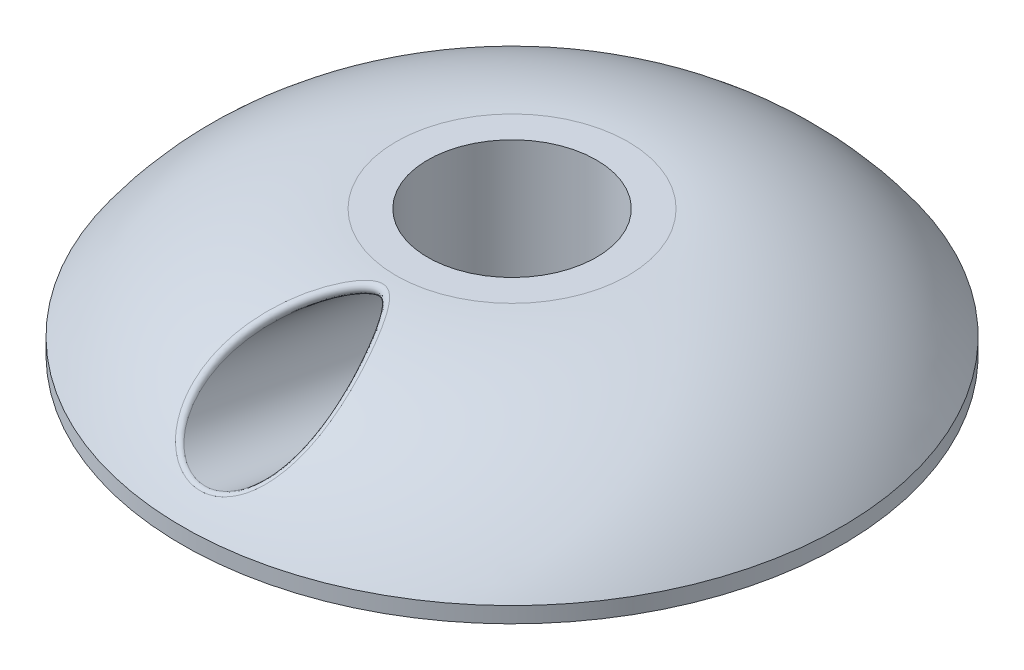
ISO-10303-21;
HEADER;
FILE_DESCRIPTION(('STEP AP214'),'2;1');
FILE_NAME('part.step','',(''),(''),'','','');
FILE_SCHEMA(('AUTOMOTIVE_DESIGN { 1 0 10303 214 1 1 1 1 }'));
ENDSEC;
DATA;
#1=APPLICATION_CONTEXT('core data for automotive mechanical design processes');
#2=APPLICATION_PROTOCOL_DEFINITION('international standard','automotive_design',2000,#1);
#3=PRODUCT_CONTEXT('',#1,'mechanical');
#4=PRODUCT('Part','Part','',(#3));
#5=PRODUCT_RELATED_PRODUCT_CATEGORY('part','',(#4));
#6=PRODUCT_DEFINITION_FORMATION('','',#4);
#7=PRODUCT_DEFINITION_CONTEXT('part definition',#1,'design');
#8=PRODUCT_DEFINITION('design','',#6,#7);
#9=PRODUCT_DEFINITION_SHAPE('','',#8);
#10=(LENGTH_UNIT() NAMED_UNIT(*) SI_UNIT(.MILLI.,.METRE.));
#11=(NAMED_UNIT(*) PLANE_ANGLE_UNIT() SI_UNIT($,.RADIAN.));
#12=(NAMED_UNIT(*) SI_UNIT($,.STERADIAN.) SOLID_ANGLE_UNIT());
#13=UNCERTAINTY_MEASURE_WITH_UNIT(LENGTH_MEASURE(1.E-05),#10,'distance_accuracy_value','');
#14=(GEOMETRIC_REPRESENTATION_CONTEXT(3) GLOBAL_UNCERTAINTY_ASSIGNED_CONTEXT((#13)) GLOBAL_UNIT_ASSIGNED_CONTEXT((#10,
#11,#12)) REPRESENTATION_CONTEXT('',''));
#15=CARTESIAN_POINT('',(0.,0.,0.));
#16=DIRECTION('',(0.,0.,1.));
#17=DIRECTION('',(1.,0.,0.));
#18=AXIS2_PLACEMENT_3D('',#15,#16,#17);
#19=CARTESIAN_POINT('',(0.,0.,0.));
#20=DIRECTION('',(0.,-1.,0.));
#21=DIRECTION('',(0.,0.,-1.));
#22=AXIS2_PLACEMENT_3D('',#19,#20,#21);
#23=CYLINDRICAL_SURFACE('',#22,8.);
#24=CARTESIAN_POINT('',(0.,12.,0.));
#25=DIRECTION('',(0.,-1.,0.));
#26=DIRECTION('',(0.,0.,-1.));
#27=AXIS2_PLACEMENT_3D('',#24,#25,#26);
#28=CIRCLE('',#27,8.);
#29=CARTESIAN_POINT('',(0.,12.,-8.));
#30=VERTEX_POINT('',#29);
#31=EDGE_CURVE('E98',#30,#30,#28,.T.);
#32=ORIENTED_EDGE('',*,*,#31,.F.);
#33=EDGE_LOOP('',(#32));
#34=FACE_BOUND('',#33,.T.);
#35=CARTESIAN_POINT('',(0.,0.,0.));
#36=DIRECTION('',(0.,-1.,0.));
#37=DIRECTION('',(0.,0.,-1.));
#38=AXIS2_PLACEMENT_3D('',#35,#36,#37);
#39=CIRCLE('',#38,8.);
#40=CARTESIAN_POINT('',(0.,0.,-8.));
#41=VERTEX_POINT('',#40);
#42=EDGE_CURVE('E44',#41,#41,#39,.T.);
#43=ORIENTED_EDGE('',*,*,#42,.T.);
#44=EDGE_LOOP('',(#43));
#45=FACE_BOUND('',#44,.T.);
#46=CARTESIAN_POINT('',(0.,10.2127009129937,8.));
#47=CARTESIAN_POINT('',(-0.120131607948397,10.2127002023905,7.9999994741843));
#48=CARTESIAN_POINT('',(-0.240273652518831,10.2078187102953,7.99728721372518));
#49=CARTESIAN_POINT('',(-0.47957953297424,10.1883830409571,7.98651118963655));
#50=CARTESIAN_POINT('',(-0.598742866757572,10.1738241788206,7.97844483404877));
#51=CARTESIAN_POINT('',(-0.835242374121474,10.1352799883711,7.95716580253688));
#52=CARTESIAN_POINT('',(-0.952575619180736,10.1112808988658,7.94394561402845));
#53=CARTESIAN_POINT('',(-1.18442463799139,10.054273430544,7.91270062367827));
#54=CARTESIAN_POINT('',(-1.29893907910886,10.0212608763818,7.89467359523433));
#55=CARTESIAN_POINT('',(-1.52356013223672,9.94703368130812,7.85440570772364));
#56=CARTESIAN_POINT('',(-1.63369265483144,9.90588015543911,7.83219630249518));
#57=CARTESIAN_POINT('',(-1.84988638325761,9.81579461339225,7.78397086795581));
#58=CARTESIAN_POINT('',(-1.95594610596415,9.76685979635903,7.75795346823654));
#59=CARTESIAN_POINT('',(-2.26725415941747,9.60931575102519,7.67499969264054));
#60=CARTESIAN_POINT('',(-2.46579267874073,9.48991239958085,7.61313159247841));
#61=CARTESIAN_POINT('',(-2.90908938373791,9.1804744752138,7.45722330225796));
#62=CARTESIAN_POINT('',(-3.14553898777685,8.98036913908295,7.35952158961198));
#63=CARTESIAN_POINT('',(-3.47103072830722,8.65349604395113,7.20876893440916));
#64=CARTESIAN_POINT('',(-3.57479328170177,8.53990176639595,7.15774103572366));
#65=CARTESIAN_POINT('',(-3.77247901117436,8.30446359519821,7.05554816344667));
#66=CARTESIAN_POINT('',(-3.86640301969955,8.18262040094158,7.00438320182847));
#67=CARTESIAN_POINT('',(-4.0453227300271,7.92974063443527,6.90261494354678));
#68=CARTESIAN_POINT('',(-4.13019019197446,7.79860711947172,6.85202698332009));
#69=CARTESIAN_POINT('',(-4.2893077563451,7.52912328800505,6.75356209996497));
#70=CARTESIAN_POINT('',(-4.36355656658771,7.39077209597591,6.70568550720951));
#71=CARTESIAN_POINT('',(-4.56952620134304,6.96599839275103,6.56860353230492));
#72=CARTESIAN_POINT('',(-4.68494685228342,6.66918314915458,6.48566107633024));
#73=CARTESIAN_POINT('',(-4.84293612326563,6.1313928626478,6.36813874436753));
#74=CARTESIAN_POINT('',(-4.89653429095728,5.89519829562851,6.32663844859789));
#75=CARTESIAN_POINT('',(-4.95329434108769,5.53515521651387,6.28214993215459));
#76=CARTESIAN_POINT('',(-4.96827424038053,5.41420512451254,6.27028129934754));
#77=CARTESIAN_POINT('',(-4.98994735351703,5.17112562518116,6.2530498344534));
#78=CARTESIAN_POINT('',(-4.9966440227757,5.04899673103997,6.24768428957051));
#79=CARTESIAN_POINT('',(-5.00141452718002,4.80358733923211,6.2438658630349));
#80=CARTESIAN_POINT('',(-4.99942689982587,4.68030481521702,6.24546225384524));
#81=CARTESIAN_POINT('',(-4.98645404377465,4.43451084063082,6.25582495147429));
#82=CARTESIAN_POINT('',(-4.97546885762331,4.31199938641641,6.2645912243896));
#83=CARTESIAN_POINT('',(-4.94443106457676,4.06881082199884,6.28911681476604));
#84=CARTESIAN_POINT('',(-4.92437623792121,3.94813416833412,6.30487784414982));
#85=CARTESIAN_POINT('',(-4.87530955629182,3.70966940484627,6.34289501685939));
#86=CARTESIAN_POINT('',(-4.84629793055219,3.59188122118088,6.36515099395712));
#87=CARTESIAN_POINT('',(-4.78269861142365,3.37091247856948,6.41305083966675));
#88=CARTESIAN_POINT('',(-4.74888619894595,3.26739603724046,6.43818317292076));
#89=CARTESIAN_POINT('',(-4.67437753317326,3.06394702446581,6.49248195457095));
#90=CARTESIAN_POINT('',(-4.63367900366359,2.96401565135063,6.52164973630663));
#91=CARTESIAN_POINT('',(-4.50169512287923,2.67025456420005,6.61409547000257));
#92=CARTESIAN_POINT('',(-4.40048910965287,2.48234651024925,6.68234126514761));
#93=CARTESIAN_POINT('',(-4.1607434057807,2.10343793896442,6.83452023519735));
#94=CARTESIAN_POINT('',(-4.01919477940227,1.91472852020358,6.91935380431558));
#95=CARTESIAN_POINT('',(-3.70909053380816,1.56142713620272,7.09041443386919));
#96=CARTESIAN_POINT('',(-3.54051694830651,1.39685135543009,7.17664238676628));
#97=CARTESIAN_POINT('',(-3.25560613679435,1.15756741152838,7.30851048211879));
#98=CARTESIAN_POINT('',(-3.14720650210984,1.07422224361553,7.35593677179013));
#99=CARTESIAN_POINT('',(-2.92293415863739,0.916491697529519,7.4478935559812));
#100=CARTESIAN_POINT('',(-2.80706376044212,0.842103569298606,7.49242493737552));
#101=CARTESIAN_POINT('',(-2.56840148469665,0.702621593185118,7.5775575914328));
#102=CARTESIAN_POINT('',(-2.44560617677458,0.637532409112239,7.6181568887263));
#103=CARTESIAN_POINT('',(-2.19390877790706,0.517127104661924,7.69441640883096));
#104=CARTESIAN_POINT('',(-2.06500956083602,0.461806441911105,7.73007892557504));
#105=CARTESIAN_POINT('',(-1.80203736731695,0.361388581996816,7.79557558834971));
#106=CARTESIAN_POINT('',(-1.66797082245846,0.316279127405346,7.82541671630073));
#107=CARTESIAN_POINT('',(-1.39553240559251,0.236622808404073,7.87856201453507));
#108=CARTESIAN_POINT('',(-1.25716248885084,0.202071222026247,7.90186910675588));
#109=CARTESIAN_POINT('',(-0.977195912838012,0.143867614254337,7.94135160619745));
#110=CARTESIAN_POINT('',(-0.835600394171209,0.120211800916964,7.95752949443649));
#111=CARTESIAN_POINT('',(-0.550342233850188,0.0840499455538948,7.98233132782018));
#112=CARTESIAN_POINT('',(-0.406679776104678,0.0715429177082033,7.99095594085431));
#113=CARTESIAN_POINT('',(-0.131066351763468,0.0584179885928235,8.00000975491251));
#114=CARTESIAN_POINT('',(0.000819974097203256,0.0568632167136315,8.00108473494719));
#115=CARTESIAN_POINT('',(0.264304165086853,0.0631884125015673,7.99671852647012));
#116=CARTESIAN_POINT('',(0.395901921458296,0.0710714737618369,7.99127520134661));
#117=CARTESIAN_POINT('',(0.657713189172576,0.0961933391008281,7.97399633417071));
#118=CARTESIAN_POINT('',(0.787927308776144,0.11342784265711,7.96216373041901));
#119=CARTESIAN_POINT('',(1.04613926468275,0.157090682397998,7.93236991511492));
#120=CARTESIAN_POINT('',(1.17413624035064,0.183522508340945,7.91440637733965));
#121=CARTESIAN_POINT('',(1.4240553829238,0.244625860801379,7.87322832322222));
#122=CARTESIAN_POINT('',(1.54604959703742,0.279091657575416,7.85014551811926));
#123=CARTESIAN_POINT('',(1.78633002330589,0.356299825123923,7.79898372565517));
#124=CARTESIAN_POINT('',(1.90461489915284,0.399045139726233,7.77090296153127));
#125=CARTESIAN_POINT('',(2.25282899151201,0.53925774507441,7.67998220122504));
#126=CARTESIAN_POINT('',(2.4763189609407,0.648751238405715,7.61042927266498));
#127=CARTESIAN_POINT('',(2.91600562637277,0.905831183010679,7.45353749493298));
#128=CARTESIAN_POINT('',(3.1306354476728,1.05552451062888,7.36530264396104));
#129=CARTESIAN_POINT('',(3.53120318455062,1.38651137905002,7.18185879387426));
#130=CARTESIAN_POINT('',(3.7171085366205,1.56784029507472,7.08664205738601));
#131=CARTESIAN_POINT('',(3.97732557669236,1.86878181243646,6.94202896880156));
#132=CARTESIAN_POINT('',(4.06341934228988,1.97803916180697,6.89185267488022));
#133=CARTESIAN_POINT('',(4.22553980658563,2.20466380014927,6.79365631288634));
#134=CARTESIAN_POINT('',(4.30157131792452,2.32202717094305,6.74563522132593));
#135=CARTESIAN_POINT('',(4.44281978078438,2.56430523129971,6.65345520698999));
#136=CARTESIAN_POINT('',(4.50805071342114,2.6892098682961,6.60929132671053));
#137=CARTESIAN_POINT('',(4.62710022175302,2.9460840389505,6.52650013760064));
#138=CARTESIAN_POINT('',(4.68092294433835,3.07805098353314,6.48787081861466));
#139=CARTESIAN_POINT('',(4.76531126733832,3.31655357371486,6.42603061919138));
#140=CARTESIAN_POINT('',(4.79837253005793,3.42182577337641,6.40132616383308));
#141=CARTESIAN_POINT('',(4.85713922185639,3.63541471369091,6.35685132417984));
#142=CARTESIAN_POINT('',(4.88284610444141,3.7437308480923,6.33707996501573));
#143=CARTESIAN_POINT('',(4.92669962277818,3.96263143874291,6.30304711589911));
#144=CARTESIAN_POINT('',(4.94485317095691,4.07321372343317,6.28878058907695));
#145=CARTESIAN_POINT('',(4.9735543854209,4.29595932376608,6.26610656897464));
#146=CARTESIAN_POINT('',(4.98410180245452,4.40812269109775,6.25769926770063));
#147=CARTESIAN_POINT('',(4.9976251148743,4.63310076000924,6.24690499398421));
#148=CARTESIAN_POINT('',(5.00060721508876,4.74591485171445,6.24451308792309));
#149=CARTESIAN_POINT('',(4.99918702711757,4.97148033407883,6.24564764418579));
#150=CARTESIAN_POINT('',(4.9947823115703,5.08423169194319,6.24917605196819));
#151=CARTESIAN_POINT('',(4.97084517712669,5.42135562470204,6.26827089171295));
#152=CARTESIAN_POINT('',(4.94058765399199,5.644559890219,6.2923486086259));
#153=CARTESIAN_POINT('',(4.84091899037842,6.15008432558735,6.369498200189));
#154=CARTESIAN_POINT('',(4.76235175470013,6.42956285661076,6.42919346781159));
#155=CARTESIAN_POINT('',(4.61574781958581,6.83388585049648,6.53440622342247));
#156=CARTESIAN_POINT('',(4.56200296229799,6.96633292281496,6.57214543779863));
#157=CARTESIAN_POINT('',(4.4453744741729,7.22591327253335,6.65158897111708));
#158=CARTESIAN_POINT('',(4.382491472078,7.35304691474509,6.69329301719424));
#159=CARTESIAN_POINT('',(4.17810449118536,7.73075293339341,6.82421540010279));
#160=CARTESIAN_POINT('',(4.02274733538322,7.97246861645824,6.91781792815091));
#161=CARTESIAN_POINT('',(3.67771438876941,8.42873709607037,7.10726279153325));
#162=CARTESIAN_POINT('',(3.48805522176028,8.64330296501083,7.20310402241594));
#163=CARTESIAN_POINT('',(3.08610311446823,9.03022098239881,7.38389654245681));
#164=CARTESIAN_POINT('',(2.87553068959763,9.20420233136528,7.46915557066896));
#165=CARTESIAN_POINT('',(2.42572588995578,9.51757349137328,7.62709160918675));
#166=CARTESIAN_POINT('',(2.18651799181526,9.65699253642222,7.69977923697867));
#167=CARTESIAN_POINT('',(1.72751901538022,9.8727192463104,7.81416512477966));
#168=CARTESIAN_POINT('',(1.51177329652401,9.95582722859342,7.85907030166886));
#169=CARTESIAN_POINT('',(1.17898134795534,10.0556573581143,7.91344951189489));
#170=CARTESIAN_POINT('',(1.06660044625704,10.0847841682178,7.92940644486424));
#171=CARTESIAN_POINT('',(0.839406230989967,10.1343767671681,7.95666099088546));
#172=CARTESIAN_POINT('',(0.724594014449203,10.1548463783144,7.96796066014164));
#173=CARTESIAN_POINT('',(0.508317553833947,10.1847082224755,7.98447335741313));
#174=CARTESIAN_POINT('',(0.407047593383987,10.1951907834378,7.99028460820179));
#175=CARTESIAN_POINT('',(0.203854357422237,10.2091882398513,7.99804860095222));
#176=CARTESIAN_POINT('',(0.101930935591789,10.2127015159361,8.0000004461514));
#177=CARTESIAN_POINT('',(0.,10.2127009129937,8.));
#178=B_SPLINE_CURVE_WITH_KNOTS('',3,(#46,#47,#48,#49,#50,#51,#52,#53,#54,#55,#56,#57,#58,#59,
#60,#61,#62,#63,#64,#65,#66,#67,#68,#69,#70,#71,#72,#73,#74,#75,#76,#77,#78,#79,#80,#81,#82,#83,
#84,#85,#86,#87,#88,#89,#90,#91,#92,#93,#94,#95,#96,#97,#98,#99,#100,#101,#102,#103,#104,#105,
#106,#107,#108,#109,#110,#111,#112,#113,#114,#115,#116,#117,#118,#119,#120,#121,#122,#123,#124,
#125,#126,#127,#128,#129,#130,#131,#132,#133,#134,#135,#136,#137,#138,#139,#140,#141,#142,#143,
#144,#145,#146,#147,#148,#149,#150,#151,#152,#153,#154,#155,#156,#157,#158,#159,#160,#161,#162,
#163,#164,#165,#166,#167,#168,#169,#170,#171,#172,#173,#174,#175,#176,#177),.UNSPECIFIED.,.T.,
.F.,(4,2,2,2,2,2,2,2,2,2,2,2,2,2,2,2,2,2,2,2,2,2,2,2,2,2,2,2,2,2,2,2,2,2,2,2,2,2,2,2,2,2,2,2,2,
2,2,2,2,2,2,2,2,2,2,2,2,2,2,2,2,2,2,2,2,4),(0.,0.360284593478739,0.720743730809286,
1.08173027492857,1.44288432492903,1.8014235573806,2.16009213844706,2.87691631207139,
3.84589537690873,4.33179508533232,4.81765364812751,5.3096697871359,5.80174574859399,
6.7833099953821,7.51748601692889,7.88443888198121,8.25123861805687,8.62063854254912,
8.99003672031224,9.35952535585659,9.72900453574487,10.0639276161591,10.3989616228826,
11.0686771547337,11.8180588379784,12.567940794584,13.001696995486,13.4353196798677,
13.8691590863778,14.302796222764,14.7359100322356,15.1688298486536,15.6015988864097,
16.0343296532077,16.429538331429,16.8248765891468,17.2200331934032,17.615339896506,
18.0014612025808,18.3877200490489,19.1596144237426,19.9847614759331,20.8108371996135,
21.2539843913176,21.69691885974,22.1392753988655,22.5814708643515,22.9203340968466,
23.2591303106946,23.5976157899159,23.9361123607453,24.2743312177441,24.6126612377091,
25.2894346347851,26.1735724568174,26.6167436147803,27.0598842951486,27.9630261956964,
28.8657315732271,29.7208436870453,30.5752300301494,31.2785472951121,31.629733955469,
31.9807653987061,32.2863936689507,32.5920929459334),.UNSPECIFIED.);
#179=CARTESIAN_POINT('',(0.,10.2127009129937,8.));
#180=VERTEX_POINT('',#179);
#181=EDGE_CURVE('E84',#180,#180,#178,.T.);
#182=ORIENTED_EDGE('',*,*,#181,.T.);
#183=EDGE_LOOP('',(#182));
#184=FACE_BOUND('',#183,.T.);
#185=ADVANCED_FACE('F30',(#34,#45,#184),#23,.F.);
#186=CARTESIAN_POINT('',(0.,-12.7767857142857,0.));
#187=DIRECTION('',(0.,-1.,0.));
#188=DIRECTION('',(0.,0.,-1.));
#189=AXIS2_PLACEMENT_3D('',#186,#187,#188);
#190=DEGENERATE_TOROIDAL_SURFACE('',#189,11.,24.7767857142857,.T.);
#191=CARTESIAN_POINT('',(2.1879749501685,10.8132610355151,14.3091668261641));
#192=CARTESIAN_POINT('',(1.91662367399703,10.984354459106,14.5190000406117));
#193=CARTESIAN_POINT('',(2.00815216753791,11.3565721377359,14.5156853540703));
#194=CARTESIAN_POINT('',(2.09968066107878,11.7287898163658,14.5123706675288));
#195=CARTESIAN_POINT('',(2.41856338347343,11.750991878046,14.300816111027));
#196=CARTESIAN_POINT('',(2.28146597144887,10.7938114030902,14.4608797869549));
#197=CARTESIAN_POINT('',(2.01324671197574,10.9693091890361,14.6644173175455));
#198=CARTESIAN_POINT('',(2.10855316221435,11.3368528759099,14.6632826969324));
#199=CARTESIAN_POINT('',(2.20314792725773,11.7045362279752,14.6611018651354));
#200=CARTESIAN_POINT('',(2.5223457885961,11.7265686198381,14.4566589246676));
#201=CARTESIAN_POINT('',(2.37197888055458,10.7725099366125,14.6144309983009));
#202=CARTESIAN_POINT('',(2.10776648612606,10.9520659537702,14.8129050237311));
#203=CARTESIAN_POINT('',(2.20630772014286,11.3150214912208,14.8134148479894));
#204=CARTESIAN_POINT('',(2.30420369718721,11.6781386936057,14.8128988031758));
#205=CARTESIAN_POINT('',(2.62288199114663,11.7000400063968,14.6144087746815));
#206=CARTESIAN_POINT('',(2.54794862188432,10.7261447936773,14.9241782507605));
#207=CARTESIAN_POINT('',(2.29228466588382,10.9132430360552,15.1134897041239));
#208=CARTESIAN_POINT('',(2.39707271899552,11.2671138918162,15.1172830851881));
#209=CARTESIAN_POINT('',(2.50122148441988,11.6211456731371,15.1200562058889));
#210=CARTESIAN_POINT('',(2.81843781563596,11.6427245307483,14.9326658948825));
#211=CARTESIAN_POINT('',(2.6334046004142,10.701080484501,15.0803747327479));
#212=CARTESIAN_POINT('',(2.38233877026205,10.8916861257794,15.2656058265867));
#213=CARTESIAN_POINT('',(2.49008235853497,11.2410369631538,15.2710197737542));
#214=CARTESIAN_POINT('',(2.5972447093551,11.5905694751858,15.2754370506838));
#215=CARTESIAN_POINT('',(2.91345650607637,11.6119369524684,15.0931736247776));
#216=CARTESIAN_POINT('',(2.8831747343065,10.6201341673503,15.552102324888));
#217=CARTESIAN_POINT('',(2.64552272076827,10.8207045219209,15.7246406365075));
#218=CARTESIAN_POINT('',(2.76269116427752,11.1563693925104,15.7363788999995));
#219=CARTESIAN_POINT('',(2.87753902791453,11.4927527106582,15.7441646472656));
#220=CARTESIAN_POINT('',(3.19130480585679,11.5130780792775,15.5779851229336));
#221=CARTESIAN_POINT('',(3.0407624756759,10.5585257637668,15.8705577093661));
#222=CARTESIAN_POINT('',(2.81351221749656,10.7646637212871,16.0371061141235));
#223=CARTESIAN_POINT('',(2.93573129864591,11.0913694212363,16.0519413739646));
#224=CARTESIAN_POINT('',(3.05600025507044,11.4189426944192,16.0630208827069));
#225=CARTESIAN_POINT('',(3.36678381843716,11.4385446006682,15.9053575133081));
#226=CARTESIAN_POINT('',(3.33965551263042,10.4199864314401,16.5113594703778));
#227=CARTESIAN_POINT('',(3.13339240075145,10.6353229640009,16.6674017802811));
#228=CARTESIAN_POINT('',(3.26520052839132,10.9443779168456,16.6884940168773));
#229=CARTESIAN_POINT('',(3.3950972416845,11.2542880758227,16.7058814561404));
#230=CARTESIAN_POINT('',(3.69986868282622,11.2722549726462,16.5642847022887));
#231=CARTESIAN_POINT('',(3.48098423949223,10.3430779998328,16.8336994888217));
#232=CARTESIAN_POINT('',(3.28560658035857,10.562201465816,16.9853868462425));
#233=CARTESIAN_POINT('',(3.42165350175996,10.8624113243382,17.009475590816));
#234=CARTESIAN_POINT('',(3.55608581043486,11.1636064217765,17.0300479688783));
#235=CARTESIAN_POINT('',(3.85750024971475,11.1805241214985,16.895832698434));
#236=CARTESIAN_POINT('',(3.74765353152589,10.1738993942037,17.4807955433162));
#237=CARTESIAN_POINT('',(3.5739072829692,10.3988428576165,17.6247116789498));
#238=CARTESIAN_POINT('',(3.71793043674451,10.6815355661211,17.6548639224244));
#239=CARTESIAN_POINT('',(3.86035874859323,10.965202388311,17.6815412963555));
#240=CARTESIAN_POINT('',(4.15514255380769,10.9798215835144,17.5616039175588));
#241=CARTESIAN_POINT('',(3.87299916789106,10.0816341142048,17.8055507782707));
#242=CARTESIAN_POINT('',(3.71025867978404,10.3087452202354,17.9462073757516));
#243=CARTESIAN_POINT('',(3.85775967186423,10.5826317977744,17.9792695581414));
#244=CARTESIAN_POINT('',(4.00393019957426,10.8576080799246,18.0090298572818));
#245=CARTESIAN_POINT('',(4.29515887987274,10.8708553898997,17.8958262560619));
#246=CARTESIAN_POINT('',(4.1291239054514,9.86288937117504,18.5179911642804));
#247=CARTESIAN_POINT('',(3.98981184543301,10.0931631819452,18.6515484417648));
#248=CARTESIAN_POINT('',(4.14464318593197,10.3476921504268,18.6917284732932));
#249=CARTESIAN_POINT('',(4.29761453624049,10.6037441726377,18.7272866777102));
#250=CARTESIAN_POINT('',(4.5814641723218,10.6135192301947,18.6292499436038));
#251=CARTESIAN_POINT('',(4.25641680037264,9.73323986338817,18.9059185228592));
#252=CARTESIAN_POINT('',(4.1300856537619,9.96414350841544,19.0366786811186));
#253=CARTESIAN_POINT('',(4.28802936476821,10.2081715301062,19.0801728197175));
#254=CARTESIAN_POINT('',(4.44452536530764,10.4538879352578,19.1193225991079));
#255=CARTESIAN_POINT('',(4.72389748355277,10.4615959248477,19.0287413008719));
#256=CARTESIAN_POINT('',(4.48466996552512,9.45289980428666,19.6814824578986));
#257=CARTESIAN_POINT('',(4.3834002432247,9.6828790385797,19.8072553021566));
#258=CARTESIAN_POINT('',(4.54688861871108,9.90605460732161,19.8575141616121));
#259=CARTESIAN_POINT('',(4.70894660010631,10.1309008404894,19.9034746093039));
#260=CARTESIAN_POINT('',(4.9795494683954,10.1341973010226,19.8277075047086));
#261=CARTESIAN_POINT('',(4.58562024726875,9.30220130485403,20.0691188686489));
#262=CARTESIAN_POINT('',(4.49681300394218,9.53078937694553,20.1929495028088));
#263=CARTESIAN_POINT('',(4.66235110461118,9.74344958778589,20.2464112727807));
#264=CARTESIAN_POINT('',(4.82685563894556,9.95791204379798,20.2958454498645));
#265=CARTESIAN_POINT('',(5.09275706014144,9.95871308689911,20.2271822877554));
#266=CARTESIAN_POINT('',(4.75743043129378,8.98106098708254,20.8413629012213));
#267=CARTESIAN_POINT('',(4.69233282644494,9.20483581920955,20.9617677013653));
#268=CARTESIAN_POINT('',(4.86123330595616,9.39661259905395,21.0217581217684));
#269=CARTESIAN_POINT('',(5.02911548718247,9.59016544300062,21.0777769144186));
#270=CARTESIAN_POINT('',(5.28571425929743,9.58569333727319,21.0232942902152));
#271=CARTESIAN_POINT('',(4.82833325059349,8.81064777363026,21.2259740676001));
#272=CARTESIAN_POINT('',(4.77485812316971,9.03113383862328,21.345136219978));
#273=CARTESIAN_POINT('',(4.94469870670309,9.21241195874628,21.4082105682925));
#274=CARTESIAN_POINT('',(5.1139125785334,9.39555782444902,21.4675885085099));
#275=CARTESIAN_POINT('',(5.36551158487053,9.38818976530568,21.4199347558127));
#276=CARTESIAN_POINT('',(4.93581994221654,8.45171267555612,21.9900042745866));
#277=CARTESIAN_POINT('',(4.90407742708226,8.66377494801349,22.1070137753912));
#278=CARTESIAN_POINT('',(5.07500123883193,8.82419106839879,22.1763919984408));
#279=CARTESIAN_POINT('',(5.24530439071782,8.98645584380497,22.2421128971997));
#280=CARTESIAN_POINT('',(5.48689098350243,8.97299917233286,22.208140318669));
#281=CARTESIAN_POINT('',(4.97242733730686,8.26320330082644,22.3694266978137));
#282=CARTESIAN_POINT('',(4.95117119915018,8.47021880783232,22.4857835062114));
#283=CARTESIAN_POINT('',(5.12186347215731,8.62018450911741,22.5581240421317));
#284=CARTESIAN_POINT('',(5.29232356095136,8.77204997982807,22.6270923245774));
#285=CARTESIAN_POINT('',(5.52849924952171,8.75532609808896,22.5997087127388));
#286=CARTESIAN_POINT('',(5.01019781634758,7.82467124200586,23.2078533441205));
#287=CARTESIAN_POINT('',(5.01026378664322,8.01904871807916,23.3221590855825));
#288=CARTESIAN_POINT('',(5.1795115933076,8.14539173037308,23.4021295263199));
#289=CARTESIAN_POINT('',(5.34841597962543,8.27457843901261,23.4770390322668));
#290=CARTESIAN_POINT('',(5.57239631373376,8.24972204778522,23.4652768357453));
#291=CARTESIAN_POINT('',(5.0011365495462,7.57053916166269,23.6648415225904));
#292=CARTESIAN_POINT('',(5.01226355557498,7.75649805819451,23.7791452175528));
#293=CARTESIAN_POINT('',(5.17937136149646,7.87010958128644,23.8624851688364));
#294=CARTESIAN_POINT('',(5.34686368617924,7.98655217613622,23.9413453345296));
#295=CARTESIAN_POINT('',(5.56328890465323,7.95722546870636,23.9372662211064));
#296=CARTESIAN_POINT('',(4.91184494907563,7.04578988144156,24.5585780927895));
#297=CARTESIAN_POINT('',(4.94152122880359,7.212958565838,24.6729607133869));
#298=CARTESIAN_POINT('',(5.1029424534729,7.30148707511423,24.7633525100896));
#299=CARTESIAN_POINT('',(5.26473320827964,7.39279421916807,24.8493367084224));
#300=CARTESIAN_POINT('',(5.46568447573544,7.35412918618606,24.8607224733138));
#301=CARTESIAN_POINT('',(4.83171414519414,6.7751962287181,24.9953538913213));
#302=CARTESIAN_POINT('',(4.86958049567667,6.931934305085,25.1104107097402));
#303=CARTESIAN_POINT('',(5.02676025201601,7.00817250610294,25.2038910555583));
#304=CARTESIAN_POINT('',(5.18499906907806,7.08699668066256,25.2936538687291));
#305=CARTESIAN_POINT('',(5.37729848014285,7.04355536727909,25.3122171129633));
#306=CARTESIAN_POINT('',(4.61572046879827,6.29129017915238,25.7416708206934));
#307=CARTESIAN_POINT('',(4.66419329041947,6.42811175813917,25.8584766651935));
#308=CARTESIAN_POINT('',(4.8125634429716,6.4835181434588,25.9570347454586));
#309=CARTESIAN_POINT('',(4.96156275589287,6.54047180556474,26.053375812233));
#310=CARTESIAN_POINT('',(5.13809346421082,6.48875921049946,26.0839794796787));
#311=CARTESIAN_POINT('',(4.496620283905,6.07890587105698,26.0576011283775));
#312=CARTESIAN_POINT('',(4.5488956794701,6.20681706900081,26.1751673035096));
#313=CARTESIAN_POINT('',(4.69249201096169,6.25321072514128,26.2759939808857));
#314=CARTESIAN_POINT('',(4.83699896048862,6.300982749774,26.3749709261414));
#315=CARTESIAN_POINT('',(5.00598163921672,6.24546442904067,26.4107846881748));
#316=CARTESIAN_POINT('',(4.20289267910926,5.65956423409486,26.662731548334));
#317=CARTESIAN_POINT('',(4.26009802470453,5.76955028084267,26.7816606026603));
#318=CARTESIAN_POINT('',(4.39290808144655,5.79842877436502,26.8871492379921));
#319=CARTESIAN_POINT('',(4.52660798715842,5.82866206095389,26.9908146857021));
#320=CARTESIAN_POINT('',(4.67977752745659,5.76541732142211,27.0369159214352));
#321=CARTESIAN_POINT('',(4.02833335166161,5.45260058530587,26.9519638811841));
#322=CARTESIAN_POINT('',(4.08691490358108,5.55338682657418,27.0718687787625));
#323=CARTESIAN_POINT('',(4.21346846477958,5.57394745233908,27.1793775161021));
#324=CARTESIAN_POINT('',(4.3411121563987,5.59561720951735,27.285475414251));
#325=CARTESIAN_POINT('',(4.48576124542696,5.52865735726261,27.3362750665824));
#326=CARTESIAN_POINT('',(3.66547508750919,5.09992787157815,27.4326166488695));
#327=CARTESIAN_POINT('',(3.72381713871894,5.18472567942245,27.5542416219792));
#328=CARTESIAN_POINT('',(3.83822380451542,5.1913967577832,27.6651602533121));
#329=CARTESIAN_POINT('',(3.95328990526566,5.19874182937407,27.7752248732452));
#330=CARTESIAN_POINT('',(4.0822002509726,5.1254238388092,27.8338752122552));
#331=CARTESIAN_POINT('',(3.48896306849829,4.9508655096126,27.6314514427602));
#332=CARTESIAN_POINT('',(3.54653046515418,5.02881580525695,27.7538378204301));
#333=CARTESIAN_POINT('',(3.65503614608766,5.02969636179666,27.8661720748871));
#334=CARTESIAN_POINT('',(3.76424195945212,5.03110189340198,27.9778646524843));
#335=CARTESIAN_POINT('',(3.88581377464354,4.95506660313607,28.0397637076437));
#336=CARTESIAN_POINT('',(3.0997367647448,4.66980317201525,28.0003114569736));
#337=CARTESIAN_POINT('',(3.15412389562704,4.73482894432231,28.1239995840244));
#338=CARTESIAN_POINT('',(3.24991478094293,4.7247935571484,28.2391479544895));
#339=CARTESIAN_POINT('',(3.34639365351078,4.71527791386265,28.3536600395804));
#340=CARTESIAN_POINT('',(3.45262531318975,4.63395762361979,28.4217702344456));
#341=CARTESIAN_POINT('',(2.88706393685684,4.53778395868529,28.1703692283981));
#342=CARTESIAN_POINT('',(2.93906048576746,4.59658436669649,28.2948060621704));
#343=CARTESIAN_POINT('',(3.02802543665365,4.5815702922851,28.4111448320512));
#344=CARTESIAN_POINT('',(3.11765101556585,4.56691247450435,28.5270602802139));
#345=CARTESIAN_POINT('',(3.21586960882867,4.48318377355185,28.5979219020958));
#346=CARTESIAN_POINT('',(2.46446261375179,4.31786007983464,28.4501372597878));
#347=CARTESIAN_POINT('',(2.51062126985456,4.36628910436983,28.5757412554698));
#348=CARTESIAN_POINT('',(2.58627382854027,4.34297713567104,28.6941489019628));
#349=CARTESIAN_POINT('',(2.66239580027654,4.31991916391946,28.8122559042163));
#350=CARTESIAN_POINT('',(2.74531458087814,4.23207900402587,28.8877518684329));
#351=CARTESIAN_POINT('',(2.25952491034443,4.22627720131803,28.5651483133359));
#352=CARTESIAN_POINT('',(2.30250368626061,4.27032526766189,28.6912874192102));
#353=CARTESIAN_POINT('',(2.37175224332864,4.24361767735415,28.8105099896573));
#354=CARTESIAN_POINT('',(2.44140554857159,4.21706549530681,28.9295519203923));
#355=CARTESIAN_POINT('',(2.51708697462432,4.12753752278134,29.0069150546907));
#356=CARTESIAN_POINT('',(1.82892231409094,4.06569881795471,28.765246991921));
#357=CARTESIAN_POINT('',(1.86469633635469,4.1021132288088,28.8922348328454));
#358=CARTESIAN_POINT('',(1.92053390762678,4.06940229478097,29.0129781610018));
#359=CARTESIAN_POINT('',(1.97677333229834,4.03684737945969,29.1335401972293));
#360=CARTESIAN_POINT('',(2.03749216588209,3.94426514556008,29.2142542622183));
#361=CARTESIAN_POINT('',(1.60326527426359,3.99669480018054,28.850345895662));
#362=CARTESIAN_POINT('',(1.63493258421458,4.02976744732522,28.9777565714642));
#363=CARTESIAN_POINT('',(1.6838455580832,3.99453713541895,29.0990966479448));
#364=CARTESIAN_POINT('',(1.73305232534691,3.95937821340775,29.2203547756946));
#365=CARTESIAN_POINT('',(1.7861337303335,3.86552452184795,29.3024419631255));
#366=CARTESIAN_POINT('',(1.13545225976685,3.88544766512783,28.9869097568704));
#367=CARTESIAN_POINT('',(1.15832359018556,3.91318565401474,29.1149273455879));
#368=CARTESIAN_POINT('',(1.19284461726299,3.87384017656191,29.2373051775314));
#369=CARTESIAN_POINT('',(1.22766392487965,3.8345688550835,29.3595982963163));
#370=CARTESIAN_POINT('',(1.26500071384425,3.73859120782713,29.4439694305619));
#371=CARTESIAN_POINT('',(0.893216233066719,3.84334626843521,29.0381966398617));
#372=CARTESIAN_POINT('',(0.911266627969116,3.86902773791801,29.1664812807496));
#373=CARTESIAN_POINT('',(0.938446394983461,3.82816213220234,29.289215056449));
#374=CARTESIAN_POINT('',(0.965772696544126,3.787312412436,29.4119306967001));
#375=CARTESIAN_POINT('',(0.995136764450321,3.69056029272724,29.497124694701));
#376=CARTESIAN_POINT('',(0.401066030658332,3.78965483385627,29.1035212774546));
#377=CARTESIAN_POINT('',(0.409287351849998,3.81274849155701,29.2321043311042));
#378=CARTESIAN_POINT('',(0.421436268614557,3.76990937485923,29.3553343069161));
#379=CARTESIAN_POINT('',(0.4337347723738,3.72708773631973,29.4785445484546));
#380=CARTESIAN_POINT('',(0.446837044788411,3.6293084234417,29.5648299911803));
#381=CARTESIAN_POINT('',(0.151154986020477,3.7780525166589,29.1175740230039));
#382=CARTESIAN_POINT('',(0.154208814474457,3.80057755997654,29.246231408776));
#383=CARTESIAN_POINT('',(0.1588277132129,3.75732133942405,29.3695588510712));
#384=CARTESIAN_POINT('',(0.163422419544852,3.71406641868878,29.4928848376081));
#385=CARTESIAN_POINT('',(0.168404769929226,3.61607345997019,29.5793955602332));
#386=CARTESIAN_POINT('',(-0.324113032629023,3.78583871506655,29.1081210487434));
#387=CARTESIAN_POINT('',(-0.330696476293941,3.80873872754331,29.2367358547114));
#388=CARTESIAN_POINT('',(-0.340566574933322,3.7657690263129,29.3599906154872));
#389=CARTESIAN_POINT('',(-0.350454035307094,3.722798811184,29.483245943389));
#390=CARTESIAN_POINT('',(-0.36110092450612,3.62495569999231,29.5695978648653));
#391=CARTESIAN_POINT('',(-0.549586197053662,3.80243775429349,29.0879960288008));
#392=CARTESIAN_POINT('',(-0.560793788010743,3.82614935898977,29.2165063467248));
#393=CARTESIAN_POINT('',(-0.577476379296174,3.78377828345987,29.3396198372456));
#394=CARTESIAN_POINT('',(-0.594303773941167,3.74142683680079,29.4627110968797));
#395=CARTESIAN_POINT('',(-0.612304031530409,3.6438908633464,29.5487386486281));
#396=CARTESIAN_POINT('',(-0.993032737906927,3.86031466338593,29.0175068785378));
#397=CARTESIAN_POINT('',(-1.01303726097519,3.88681480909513,29.1456955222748));
#398=CARTESIAN_POINT('',(-1.04327406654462,3.84657202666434,29.2682742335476));
#399=CARTESIAN_POINT('',(-1.07365418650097,3.80634845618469,29.3908310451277));
#400=CARTESIAN_POINT('',(-1.10633766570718,3.70991883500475,29.4756814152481));
#401=CARTESIAN_POINT('',(-1.21100676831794,3.90159037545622,28.9671453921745));
#402=CARTESIAN_POINT('',(-1.2352997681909,3.9300995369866,29.0950791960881));
#403=CARTESIAN_POINT('',(-1.27216264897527,3.8913541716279,29.2173020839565));
#404=CARTESIAN_POINT('',(-1.30927822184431,3.85267406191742,29.3394503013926));
#405=CARTESIAN_POINT('',(-1.3491689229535,3.75700918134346,29.4234861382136));
#406=CARTESIAN_POINT('',(-1.63398479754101,4.00634315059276,28.838436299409));
#407=CARTESIAN_POINT('',(-1.66618040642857,4.03987351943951,28.965799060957));
#408=CARTESIAN_POINT('',(-1.71606402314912,4.00500499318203,29.08704450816));
#409=CARTESIAN_POINT('',(-1.76619979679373,3.97020046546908,29.208216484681));
#410=CARTESIAN_POINT('',(-1.82035174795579,3.8765344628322,29.2901002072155));
#411=CARTESIAN_POINT('',(-1.83898311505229,4.06982986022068,28.7600765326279));
#412=CARTESIAN_POINT('',(-1.87488518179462,4.10642686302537,28.8870586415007));
#413=CARTESIAN_POINT('',(-1.93107073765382,4.07388413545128,29.0077467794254));
#414=CARTESIAN_POINT('',(-1.9875894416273,4.04146992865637,29.1282856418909));
#415=CARTESIAN_POINT('',(-2.04869697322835,3.9489804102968,29.2088969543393));
#416=CARTESIAN_POINT('',(-2.23186047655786,4.21559749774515,28.5784780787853));
#417=CARTESIAN_POINT('',(-2.27434908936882,4.25912511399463,28.7046892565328));
#418=CARTESIAN_POINT('',(-2.34276874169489,4.23203103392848,28.8239973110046));
#419=CARTESIAN_POINT('',(-2.41152303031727,4.20506495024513,28.9431565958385));
#420=CARTESIAN_POINT('',(-2.486275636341,4.11534811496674,29.0207269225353));
#421=CARTESIAN_POINT('',(-2.41973465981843,4.29788373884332,28.4752323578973));
#422=CARTESIAN_POINT('',(-2.46516590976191,4.34534256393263,28.6009708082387));
#423=CARTESIAN_POINT('',(-2.53945483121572,4.32130455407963,28.7195384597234));
#424=CARTESIAN_POINT('',(-2.61412857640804,4.29746835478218,28.8378675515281));
#425=CARTESIAN_POINT('',(-2.69550364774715,4.2092759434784,28.9137528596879));
#426=CARTESIAN_POINT('',(-2.79447584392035,4.48695496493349,28.2352814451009));
#427=CARTESIAN_POINT('',(-2.84518346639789,4.54332206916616,28.3600373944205));
#428=CARTESIAN_POINT('',(-2.93129298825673,4.52642680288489,28.476804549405));
#429=CARTESIAN_POINT('',(-3.01787165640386,4.50977672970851,28.5932812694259));
#430=CARTESIAN_POINT('',(-3.11278135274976,4.42514382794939,28.6651660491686));
#431=CARTESIAN_POINT('',(-2.97916578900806,4.5954051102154,28.096201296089));
#432=CARTESIAN_POINT('',(-3.03210673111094,4.6568842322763,28.2203590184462));
#433=CARTESIAN_POINT('',(-3.12411553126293,4.64408168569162,28.336130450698));
#434=CARTESIAN_POINT('',(-3.21661771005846,4.63162433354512,28.4514828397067));
#435=CARTESIAN_POINT('',(-3.31840059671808,4.54898961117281,28.5210956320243));
#436=CARTESIAN_POINT('',(-3.32287658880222,4.82578362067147,27.7962972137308));
#437=CARTESIAN_POINT('',(-3.37914080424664,4.89791399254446,27.9193642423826));
#438=CARTESIAN_POINT('',(-3.48229002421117,4.89400592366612,28.0328482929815));
#439=CARTESIAN_POINT('',(-3.58593774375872,4.89044476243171,28.1459115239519));
#440=CARTESIAN_POINT('',(-3.70098259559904,4.81215059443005,28.2104776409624));
#441=CARTESIAN_POINT('',(-3.4818838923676,4.9477190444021,27.6354618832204));
#442=CARTESIAN_POINT('',(-3.53924007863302,5.02548112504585,27.7579094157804));
#443=CARTESIAN_POINT('',(-3.6476274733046,5.02628293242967,27.8702287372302));
#444=CARTESIAN_POINT('',(-3.75650064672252,5.027525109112,27.9819980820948));
#445=CARTESIAN_POINT('',(-3.87793022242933,4.95147389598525,28.0439182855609));
#446=CARTESIAN_POINT('',(-3.80641237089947,5.22871964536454,27.2584325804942));
#447=CARTESIAN_POINT('',(-3.86507032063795,5.3193040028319,27.3795328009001));
#448=CARTESIAN_POINT('',(-3.9841984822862,5.33110249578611,27.4891001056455));
#449=CARTESIAN_POINT('',(-4.10405102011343,5.34355651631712,27.5978469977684));
#450=CARTESIAN_POINT('',(-4.23897292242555,5.27265633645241,27.6535362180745));
#451=CARTESIAN_POINT('',(-3.96557199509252,5.39002581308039,27.0378683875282));
#452=CARTESIAN_POINT('',(-4.02400103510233,5.48787909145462,27.15820477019));
#453=CARTESIAN_POINT('',(-4.14862291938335,5.50607316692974,27.2661907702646));
#454=CARTESIAN_POINT('',(-4.27388990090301,5.52506706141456,27.373133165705));
#455=CARTESIAN_POINT('',(-4.41596623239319,5.45710071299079,27.4252022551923));
#456=CARTESIAN_POINT('',(-4.24690189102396,5.71973315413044,26.5761486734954));
#457=CARTESIAN_POINT('',(-4.30334522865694,5.83203207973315,26.695264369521));
#458=CARTESIAN_POINT('',(-4.43787038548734,5.86368313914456,26.799701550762));
#459=CARTESIAN_POINT('',(-4.57304980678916,5.89614082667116,26.9030867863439));
#460=CARTESIAN_POINT('',(-4.72866147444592,5.83429226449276,26.9473259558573));
#461=CARTESIAN_POINT('',(-4.36901492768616,5.88814485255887,26.3349620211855));
#462=CARTESIAN_POINT('',(-4.42359415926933,6.00773755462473,26.453414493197));
#463=CARTESIAN_POINT('',(-4.56263215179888,6.04633381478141,26.5560904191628));
#464=CARTESIAN_POINT('',(-4.70219904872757,6.08584464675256,26.6575129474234));
#465=CARTESIAN_POINT('',(-4.86429951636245,6.02705176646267,26.6977515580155));
#466=CARTESIAN_POINT('',(-4.54626719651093,6.17451776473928,25.9138305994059));
#467=CARTESIAN_POINT('',(-4.59641252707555,6.30591390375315,26.0317720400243));
#468=CARTESIAN_POINT('',(-4.74230040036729,6.35688648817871,26.1308639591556));
#469=CARTESIAN_POINT('',(-4.88844428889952,6.40830133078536,26.2293510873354));
#470=CARTESIAN_POINT('',(-5.06102565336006,6.35501865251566,26.2620795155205));
#471=CARTESIAN_POINT('',(-4.61045198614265,6.29205289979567,25.7378846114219));
#472=CARTESIAN_POINT('',(-4.65845895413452,6.42831812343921,25.8554897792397));
#473=CARTESIAN_POINT('',(-4.80688839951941,6.48433643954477,25.9532450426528));
#474=CARTESIAN_POINT('',(-4.95552502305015,6.54082229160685,26.0503356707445));
#475=CARTESIAN_POINT('',(-5.13220988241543,6.48967921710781,26.0800873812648));
#476=CARTESIAN_POINT('',(-4.7231360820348,6.52649845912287,25.3800321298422));
#477=CARTESIAN_POINT('',(-4.76625798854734,6.67227146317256,25.4971052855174));
#478=CARTESIAN_POINT('',(-4.91928009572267,6.73853632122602,25.5920747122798));
#479=CARTESIAN_POINT('',(-5.07250957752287,6.80527125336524,25.6863766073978));
#480=CARTESIAN_POINT('',(-5.25707344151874,6.75840496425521,25.7100009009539));
#481=CARTESIAN_POINT('',(-4.77165081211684,6.64340938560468,25.1981316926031));
#482=CARTESIAN_POINT('',(-4.81197752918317,6.79384329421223,25.3149505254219));
#483=CARTESIAN_POINT('',(-4.9671003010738,6.86528681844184,25.4085293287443));
#484=CARTESIAN_POINT('',(-5.12237888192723,6.93722477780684,25.501379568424));
#485=CARTESIAN_POINT('',(-5.31076998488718,6.89247060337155,25.5219127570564));
#486=CARTESIAN_POINT('',(-4.89538363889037,6.99199280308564,24.644337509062));
#487=CARTESIAN_POINT('',(-4.92670670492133,7.15668798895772,24.7595430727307));
#488=CARTESIAN_POINT('',(-5.08720594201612,7.24316724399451,24.8498652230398));
#489=CARTESIAN_POINT('',(-5.2483331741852,7.33161381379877,24.9372739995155));
#490=CARTESIAN_POINT('',(-5.44751984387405,7.29240238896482,24.9493810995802));
#491=CARTESIAN_POINT('',(-4.94866661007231,7.22130629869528,24.2646569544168));
#492=CARTESIAN_POINT('',(-4.97239920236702,7.39454685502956,24.3794932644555));
#493=CARTESIAN_POINT('',(-5.1360111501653,7.49169875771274,24.467027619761));
#494=CARTESIAN_POINT('',(-5.29980775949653,7.59091071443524,24.5512301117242));
#495=CARTESIAN_POINT('',(-5.50609605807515,7.55576336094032,24.556987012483));
#496=CARTESIAN_POINT('',(-4.99746301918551,7.6112530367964,23.5878905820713));
#497=CARTESIAN_POINT('',(-5.00648566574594,7.79767065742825,23.7035634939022));
#498=CARTESIAN_POINT('',(-5.17386296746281,7.91419621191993,23.7850091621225));
#499=CARTESIAN_POINT('',(-5.34134664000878,8.03190991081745,23.864541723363));
#500=CARTESIAN_POINT('',(-5.55902647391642,8.00415086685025,23.8578178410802));
#501=CARTESIAN_POINT('',(-5.00401409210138,7.77483262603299,23.2936324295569));
#502=CARTESIAN_POINT('',(-5.00607519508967,7.96666246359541,23.4094205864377));
#503=CARTESIAN_POINT('',(-5.1747142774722,8.09138747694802,23.4885865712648));
#504=CARTESIAN_POINT('',(-5.34326444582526,8.21730219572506,23.5656853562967));
#505=CARTESIAN_POINT('',(-5.56569149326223,8.19242671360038,23.5539010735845));
#506=CARTESIAN_POINT('',(-4.99139232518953,8.09262832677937,22.6994030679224));
#507=CARTESIAN_POINT('',(-4.97875327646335,8.29432973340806,22.8158747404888));
#508=CARTESIAN_POINT('',(-5.14891577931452,8.43552328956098,22.8902527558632));
#509=CARTESIAN_POINT('',(-5.318988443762,8.57791155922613,22.9625522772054));
#510=CARTESIAN_POINT('',(-5.55034394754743,8.55859497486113,22.9403393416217));
#511=CARTESIAN_POINT('',(-4.97221080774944,8.24684126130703,22.3994299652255));
#512=CARTESIAN_POINT('',(-4.95164284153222,8.45298972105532,22.5163245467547));
#513=CARTESIAN_POINT('',(-5.12225669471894,8.60246436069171,22.5883397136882));
#514=CARTESIAN_POINT('',(-5.29258441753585,8.7531202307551,22.6581253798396));
#515=CARTESIAN_POINT('',(-5.52832170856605,8.73648386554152,22.6306924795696));
#516=CARTESIAN_POINT('',(-4.91075570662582,8.54469226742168,21.7949135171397));
#517=CARTESIAN_POINT('',(-4.8737011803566,8.7587110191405,21.9131363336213));
#518=CARTESIAN_POINT('',(-5.04426449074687,8.92477119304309,21.9802108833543));
#519=CARTESIAN_POINT('',(-5.21453830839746,9.09202894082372,22.0450266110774));
#520=CARTESIAN_POINT('',(-5.4585502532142,9.08050203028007,22.006858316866));
#521=CARTESIAN_POINT('',(-4.86842777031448,8.68830454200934,21.4903610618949));
#522=CARTESIAN_POINT('',(-4.82262404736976,8.9057080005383,21.6093600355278));
#523=CARTESIAN_POINT('',(-4.99287332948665,9.08010872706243,21.6739866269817));
#524=CARTESIAN_POINT('',(-5.16263538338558,9.25567093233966,21.7362133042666));
#525=CARTESIAN_POINT('',(-5.41074048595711,9.24660258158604,21.6926620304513));
#526=CARTESIAN_POINT('',(-4.76307231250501,8.9635444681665,20.8786788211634));
#527=CARTESIAN_POINT('',(-4.69931489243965,9.18662303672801,20.9997544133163));
#528=CARTESIAN_POINT('',(-4.86801824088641,9.37766438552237,21.0592837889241));
#529=CARTESIAN_POINT('',(-5.03622964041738,9.56987783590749,21.1163922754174));
#530=CARTESIAN_POINT('',(-5.29208271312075,9.56543094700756,21.0617905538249));
#531=CARTESIAN_POINT('',(-4.70004006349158,9.09516937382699,20.5715484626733));
#532=CARTESIAN_POINT('',(-4.62688808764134,9.32048624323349,20.6937964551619));
#533=CARTESIAN_POINT('',(-4.79454927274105,9.5198795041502,20.7508047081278));
#534=CARTESIAN_POINT('',(-4.96151971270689,9.72039402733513,20.805252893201));
#535=CARTESIAN_POINT('',(-5.22122944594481,9.71815569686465,20.7451148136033));
#536=CARTESIAN_POINT('',(-4.53401251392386,9.38267309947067,19.8649181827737));
#537=CARTESIAN_POINT('',(-4.43871761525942,9.61216998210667,19.9896573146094));
#538=CARTESIAN_POINT('',(-4.60319853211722,9.83029539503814,20.0415183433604));
#539=CARTESIAN_POINT('',(-4.76650993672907,10.0503171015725,20.0890438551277));
#540=CARTESIAN_POINT('',(-5.03486881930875,10.0523714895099,20.0167305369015));
#541=CARTESIAN_POINT('',(-4.42471229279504,9.53422877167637,19.4649361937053));
#542=CARTESIAN_POINT('',(-4.31642918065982,9.76478941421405,19.5918123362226));
#543=CARTESIAN_POINT('',(-4.47860816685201,9.9937602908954,19.6403589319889));
#544=CARTESIAN_POINT('',(-4.63917919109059,10.2244779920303,19.6842713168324));
#545=CARTESIAN_POINT('',(-4.91235327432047,10.2290308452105,19.6045862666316));
#546=CARTESIAN_POINT('',(-4.17872722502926,9.81479590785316,18.6650754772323));
#547=CARTESIAN_POINT('',(-4.0444041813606,10.0454948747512,18.7974513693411));
#548=CARTESIAN_POINT('',(-4.20043293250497,10.2959567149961,18.8389800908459));
#549=CARTESIAN_POINT('',(-4.35483234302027,10.5481885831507,18.8758168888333));
#550=CARTESIAN_POINT('',(-4.63695661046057,10.5571077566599,18.7807044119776));
#551=CARTESIAN_POINT('',(-4.04204822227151,9.94381217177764,18.2651967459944));
#552=CARTESIAN_POINT('',(-3.89425258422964,10.1733982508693,18.4006651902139));
#553=CARTESIAN_POINT('',(-4.04685425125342,10.4346935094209,18.4387604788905));
#554=CARTESIAN_POINT('',(-4.19737092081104,10.6975701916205,18.4718569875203));
#555=CARTESIAN_POINT('',(-4.48408197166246,10.7085306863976,18.3689667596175));
#556=CARTESIAN_POINT('',(-3.74417724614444,10.1786016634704,17.4683207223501));
#557=CARTESIAN_POINT('',(-3.56978368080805,10.4038639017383,17.6115420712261));
#558=CARTESIAN_POINT('',(-3.71397823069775,10.6866049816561,17.6423628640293));
#559=CARTESIAN_POINT('',(-3.85606061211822,10.9709408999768,17.6681409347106));
#560=CARTESIAN_POINT('',(-4.15124804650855,10.9853038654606,17.548749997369));
#561=CARTESIAN_POINT('',(-3.58303146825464,10.2844177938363,17.0713194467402));
#562=CARTESIAN_POINT('',(-3.39506201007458,10.5062517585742,17.2189083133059));
#563=CARTESIAN_POINT('',(-3.53472939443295,10.7998268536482,17.2461787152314));
#564=CARTESIAN_POINT('',(-3.671775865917,11.0947737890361,17.2680789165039));
#565=CARTESIAN_POINT('',(-3.97133980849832,11.1107022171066,17.1402662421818));
#566=CARTESIAN_POINT('',(-3.32361643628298,10.4257595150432,16.4798376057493));
#567=CARTESIAN_POINT('',(-3.11696226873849,10.6402866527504,16.6376939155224));
#568=CARTESIAN_POINT('',(-3.24762298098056,10.9504484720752,16.6573033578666));
#569=CARTESIAN_POINT('',(-3.37762429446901,11.2609578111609,16.6755575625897));
#570=CARTESIAN_POINT('',(-3.68201578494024,11.2792685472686,16.5318841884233));
#571=CARTESIAN_POINT('',(-3.2342193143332,10.4699676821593,16.2833944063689));
#572=CARTESIAN_POINT('',(-3.02104547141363,10.6818818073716,16.4442359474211));
#573=CARTESIAN_POINT('',(-3.14890826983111,10.9974446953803,16.4619586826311));
#574=CARTESIAN_POINT('',(-3.27603819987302,11.3133234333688,16.4782825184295));
#575=CARTESIAN_POINT('',(-3.58235749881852,11.3321916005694,16.3298628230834));
#576=CARTESIAN_POINT('',(-3.04934816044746,10.5526362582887,15.8922784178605));
#577=CARTESIAN_POINT('',(-2.8234390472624,10.758689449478,16.0597871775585));
#578=CARTESIAN_POINT('',(-2.94531847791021,11.0850582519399,16.0736611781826));
#579=CARTESIAN_POINT('',(-3.06645894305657,11.4117445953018,16.0861269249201));
#580=CARTESIAN_POINT('',(-3.37637513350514,11.4315717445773,15.9277075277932));
#581=CARTESIAN_POINT('',(-2.95387434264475,10.591096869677,15.6976055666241));
#582=CARTESIAN_POINT('',(-2.7216784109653,10.7938670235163,15.8687574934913));
#583=CARTESIAN_POINT('',(-2.84044361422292,11.1256758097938,15.8807082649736));
#584=CARTESIAN_POINT('',(-2.95838840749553,11.4577689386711,15.8912058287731));
#585=CARTESIAN_POINT('',(-3.27005128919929,11.4780290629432,15.72757353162));
#586=CARTESIAN_POINT('',(-2.74401234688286,10.6668036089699,15.2862795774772));
#587=CARTESIAN_POINT('',(-2.49886563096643,10.8618966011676,15.4659795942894));
#588=CARTESIAN_POINT('',(-2.61066442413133,11.2052654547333,15.4739556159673));
#589=CARTESIAN_POINT('',(-2.72141207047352,11.5489982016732,15.480071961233));
#590=CARTESIAN_POINT('',(-3.03647388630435,11.5699676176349,15.304776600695));
#591=CARTESIAN_POINT('',(-2.62875864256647,10.7032820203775,15.0699577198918));
#592=CARTESIAN_POINT('',(-2.37701141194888,10.8938042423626,15.2548304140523));
#593=CARTESIAN_POINT('',(-2.4849037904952,11.2433809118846,15.2606029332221));
#594=CARTESIAN_POINT('',(-2.59160725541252,11.5932695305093,15.2644499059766));
#595=CARTESIAN_POINT('',(-2.90827339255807,11.6145835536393,15.0824628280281));
#596=CARTESIAN_POINT('',(-2.38890969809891,10.769090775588,14.641881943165));
#597=CARTESIAN_POINT('',(-2.12507583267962,10.9495028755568,14.8388773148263));
#598=CARTESIAN_POINT('',(-2.22450959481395,11.3115612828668,14.8401396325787));
#599=CARTESIAN_POINT('',(-2.32273968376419,11.6739341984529,14.8394641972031));
#600=CARTESIAN_POINT('',(-2.64167664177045,11.6957328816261,14.6426056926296));
#601=CARTESIAN_POINT('',(-2.26431283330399,10.7984198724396,14.4301288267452));
#602=CARTESIAN_POINT('',(-1.9948505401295,10.9732317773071,14.63402412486));
#603=CARTESIAN_POINT('',(-2.08987449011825,11.3416247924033,14.6330301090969));
#604=CARTESIAN_POINT('',(-2.18351880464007,11.7102742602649,14.6300480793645));
#605=CARTESIAN_POINT('',(-2.50327861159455,11.7322648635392,14.4250631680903));
#606=CARTESIAN_POINT('',(-2.07026668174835,10.8368347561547,14.1206991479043));
#607=CARTESIAN_POINT('',(-1.79462559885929,11.0024127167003,14.3377767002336));
#608=CARTESIAN_POINT('',(-1.8819667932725,11.3803853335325,14.3326217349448));
#609=CARTESIAN_POINT('',(-1.9689792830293,11.7584196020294,14.3269891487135));
#610=CARTESIAN_POINT('',(-2.28792051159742,11.7806738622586,14.1072248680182));
#611=CARTESIAN_POINT('',(-2.0052688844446,10.8485933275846,14.0201602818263));
#612=CARTESIAN_POINT('',(-1.72767388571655,11.0110241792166,14.2416547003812));
#613=CARTESIAN_POINT('',(-1.81259649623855,11.3921378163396,14.2353778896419));
#614=CARTESIAN_POINT('',(-1.89716512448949,11.7733056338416,14.2286215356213));
#615=CARTESIAN_POINT('',(-2.21581182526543,11.7955932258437,14.0039622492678));
#616=CARTESIAN_POINT('',(-1.87201796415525,10.8704685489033,13.8214324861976));
#617=CARTESIAN_POINT('',(-1.59130106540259,11.0263109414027,14.0526764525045));
#618=CARTESIAN_POINT('',(-1.67117978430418,11.4137454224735,14.0441520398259));
#619=CARTESIAN_POINT('',(-1.7507022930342,11.8012342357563,14.0351468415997));
#620=CARTESIAN_POINT('',(-2.06804699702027,11.8235526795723,13.7998661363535));
#621=CARTESIAN_POINT('',(-1.80376537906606,10.8805854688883,13.7232431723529));
#622=CARTESIAN_POINT('',(-1.52185661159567,11.0329780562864,13.9598204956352));
#623=CARTESIAN_POINT('',(-1.59913381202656,11.4236008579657,13.9501695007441));
#624=CARTESIAN_POINT('',(-1.67602765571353,11.814270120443,13.9400396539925));
#625=CARTESIAN_POINT('',(-1.99239144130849,11.8365930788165,13.6990322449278));
#626=CARTESIAN_POINT('',(-1.66341795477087,10.899201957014,13.53006521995));
#627=CARTESIAN_POINT('',(-1.38032700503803,11.0443826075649,13.7785294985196));
#628=CARTESIAN_POINT('',(-1.45215844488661,11.4414202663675,13.7666327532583));
#629=CARTESIAN_POINT('',(-1.52360531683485,11.8385045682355,13.7542559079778));
#630=CARTESIAN_POINT('',(-1.83689317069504,11.8608072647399,13.5006657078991));
#631=CARTESIAN_POINT('',(-1.59132603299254,10.9077027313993,13.4350742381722));
#632=CARTESIAN_POINT('',(-1.30821748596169,11.0491123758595,13.6900983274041));
#633=CARTESIAN_POINT('',(-1.37723125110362,11.4493856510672,13.6770752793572));
#634=CARTESIAN_POINT('',(-1.445830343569,11.8496970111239,13.6635828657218));
#635=CARTESIAN_POINT('',(-1.75705363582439,11.8719824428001,13.4031306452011));
#636=CARTESIAN_POINT('',(-1.44238692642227,10.9231301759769,13.2494904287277));
#637=CARTESIAN_POINT('',(-1.16117235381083,11.0566733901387,13.5192939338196));
#638=CARTESIAN_POINT('',(-1.22425401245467,11.4634479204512,13.5040458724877));
#639=CARTESIAN_POINT('',(-1.28692024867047,11.8702606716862,13.4883282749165));
#640=CARTESIAN_POINT('',(-1.59218898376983,11.8924937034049,13.2125893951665));
#641=CARTESIAN_POINT('',(-1.36554219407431,10.9300576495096,13.158895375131));
#642=CARTESIAN_POINT('',(-1.08621086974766,11.0594958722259,13.4369367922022));
#643=CARTESIAN_POINT('',(-1.14620558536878,11.4695457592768,13.4205708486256));
#644=CARTESIAN_POINT('',(-1.2057556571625,11.8796245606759,13.4037626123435));
#645=CARTESIAN_POINT('',(-1.50716654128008,11.901830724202,13.1195809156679));
#646=CARTESIAN_POINT('',(-1.20730117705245,10.9422747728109,12.9857024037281));
#647=CARTESIAN_POINT('',(-0.934946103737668,11.0632810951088,13.2822799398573));
#648=CARTESIAN_POINT('',(-0.988451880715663,11.4798147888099,13.2637573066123));
#649=CARTESIAN_POINT('',(-1.04152807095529,11.8963764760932,13.2448079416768));
#650=CARTESIAN_POINT('',(-1.33217500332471,11.9185315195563,12.941785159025));
#651=CARTESIAN_POINT('',(-1.12601717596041,10.9475926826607,12.902986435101));
#652=CARTESIAN_POINT('',(-0.858664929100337,11.0642682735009,13.2098519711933));
#653=CARTESIAN_POINT('',(-0.908805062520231,11.4840199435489,13.1902581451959));
#654=CARTESIAN_POINT('',(-0.958494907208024,11.9037900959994,13.1702892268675));
#655=CARTESIAN_POINT('',(-1.24232846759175,11.9259289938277,12.8568764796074));
#656=CARTESIAN_POINT('',(-0.95601445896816,10.9568162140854,12.7468794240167));
#657=CARTESIAN_POINT('',(-0.70416378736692,11.0646586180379,13.0769998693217));
#658=CARTESIAN_POINT('',(-0.747128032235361,11.4907417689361,13.0553922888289));
#659=CARTESIAN_POINT('',(-0.789648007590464,11.9168436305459,13.0334135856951));
#660=CARTESIAN_POINT('',(-1.0545121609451,11.9389800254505,12.696639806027));
#661=CARTESIAN_POINT('',(-0.867296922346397,10.9607220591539,12.6734869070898));
#662=CARTESIAN_POINT('',(-0.625940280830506,11.06405320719,13.0166465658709));
#663=CARTESIAN_POINT('',(-0.665098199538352,11.4932587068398,12.9940236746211));
#664=CARTESIAN_POINT('',(-0.70382682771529,11.9224733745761,12.9711285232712));
#665=CARTESIAN_POINT('',(-0.956543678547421,11.9446338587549,12.6213102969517));
#666=CARTESIAN_POINT('',(-0.702005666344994,10.9664418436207,12.5568179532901));
#667=CARTESIAN_POINT('',(-0.487939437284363,11.062001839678,12.9250465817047));
#668=CARTESIAN_POINT('',(-0.519817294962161,11.4964055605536,12.9008043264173));
#669=CARTESIAN_POINT('',(-0.551440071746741,11.9308149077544,12.876395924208));
#670=CARTESIAN_POINT('',(-0.774102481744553,11.9530738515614,12.5015672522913));
#671=CARTESIAN_POINT('',(-0.627297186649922,10.9685299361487,12.510492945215));
#672=CARTESIAN_POINT('',(-0.427998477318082,11.060776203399,12.890321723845));
#673=CARTESIAN_POINT('',(-0.456563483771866,11.4973354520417,12.8654125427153));
#674=CARTESIAN_POINT('',(-0.484916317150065,11.9338968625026,12.8404041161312));
#675=CARTESIAN_POINT('',(-0.691669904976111,11.9562201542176,12.4540235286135));
#676=CARTESIAN_POINT('',(-0.511065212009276,10.9710744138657,12.4508801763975));
#677=CARTESIAN_POINT('',(-0.339989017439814,11.0588140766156,12.8476790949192));
#678=CARTESIAN_POINT('',(-0.363296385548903,11.4982406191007,12.8219066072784));
#679=CARTESIAN_POINT('',(-0.386548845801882,11.9376676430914,12.7961086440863));
#680=CARTESIAN_POINT('',(-0.563458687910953,11.9601093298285,12.3928439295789));
#681=CARTESIAN_POINT('',(-0.471658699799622,10.9718242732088,12.4326654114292));
#682=CARTESIAN_POINT('',(-0.310964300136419,11.0581392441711,12.835039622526));
#683=CARTESIAN_POINT('',(-0.332499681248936,11.4984607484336,12.8090079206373));
#684=CARTESIAN_POINT('',(-0.353989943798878,11.9387824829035,12.7829594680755));
#685=CARTESIAN_POINT('',(-0.519996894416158,11.9612667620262,12.374150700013));
#686=CARTESIAN_POINT('',(-0.391540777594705,10.9731318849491,12.4001034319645));
#687=CARTESIAN_POINT('',(-0.253706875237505,11.056835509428,12.8130094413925));
#688=CARTESIAN_POINT('',(-0.271630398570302,11.4987819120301,12.7865189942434));
#689=CARTESIAN_POINT('',(-0.289509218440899,11.9407285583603,12.7600121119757));
#690=CARTESIAN_POINT('',(-0.431644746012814,11.9632990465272,12.3407337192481));
#691=CARTESIAN_POINT('',(-0.350829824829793,10.973689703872,12.38575487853));
#692=CARTESIAN_POINT('',(-0.225483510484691,11.0562068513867,12.8036256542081));
#693=CARTESIAN_POINT('',(-0.241557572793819,11.4988829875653,12.7769276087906));
#694=CARTESIAN_POINT('',(-0.257597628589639,11.9415591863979,12.750221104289));
#695=CARTESIAN_POINT('',(-0.386754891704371,11.9641739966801,12.3260085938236));
#696=CARTESIAN_POINT('',(-0.245276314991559,10.9748729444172,12.3547779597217));
#697=CARTESIAN_POINT('',(-0.154401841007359,11.0547799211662,12.7838060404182));
#698=CARTESIAN_POINT('',(-0.165696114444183,11.4990504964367,12.7566731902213));
#699=CARTESIAN_POINT('',(-0.176908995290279,11.9433212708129,12.729517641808));
#700=CARTESIAN_POINT('',(-0.270377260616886,11.9660393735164,12.294218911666));
#701=CARTESIAN_POINT('',(-0.1796119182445,10.9753632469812,12.3413242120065));
#702=CARTESIAN_POINT('',(-0.112210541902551,11.0540837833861,12.7757206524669));
#703=CARTESIAN_POINT('',(-0.120474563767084,11.4990663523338,12.7483839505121));
#704=CARTESIAN_POINT('',(-0.128708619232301,11.9440489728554,12.7210443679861));
#705=CARTESIAN_POINT('',(-0.19798926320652,11.9668231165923,12.2804124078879));
#706=CARTESIAN_POINT('',(-0.0471703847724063,10.9758847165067,12.3269898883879));
#707=CARTESIAN_POINT('',(-0.0290028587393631,11.0533377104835,12.7671217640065));
#708=CARTESIAN_POINT('',(-0.0311883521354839,11.4990807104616,12.7395782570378));
#709=CARTESIAN_POINT('',(-0.0333416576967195,11.9448236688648,12.7120315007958));
#710=CARTESIAN_POINT('',(-0.0519947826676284,11.967657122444,12.2657022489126));
#711=CARTESIAN_POINT('',(0.0196058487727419,10.9759162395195,12.3260995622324));
#712=CARTESIAN_POINT('',(0.011963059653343,11.0532881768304,12.7666128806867));
#713=CARTESIAN_POINT('',(0.0128771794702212,11.4990792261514,12.7390557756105));
#714=CARTESIAN_POINT('',(0.0137670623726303,11.9448702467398,12.7114967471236));
#715=CARTESIAN_POINT('',(0.0216107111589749,11.9677079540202,12.2647885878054));
#716=CARTESIAN_POINT('',(0.152174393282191,10.9755217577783,12.3369788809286));
#717=CARTESIAN_POINT('',(0.0948102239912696,11.0538590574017,12.7731061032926));
#718=CARTESIAN_POINT('',(0.101812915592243,11.4990717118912,12.7457060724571));
#719=CARTESIAN_POINT('',(0.108792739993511,11.9442843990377,12.7183044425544));
#720=CARTESIAN_POINT('',(0.167743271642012,11.9670764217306,12.2759531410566));
#721=CARTESIAN_POINT('',(0.217967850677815,10.9750963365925,12.348732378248));
#722=CARTESIAN_POINT('',(0.13663865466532,11.0544779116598,12.7800906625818));
#723=CARTESIAN_POINT('',(0.146682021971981,11.499065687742,12.7528690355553));
#724=CARTESIAN_POINT('',(0.156649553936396,11.9436535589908,12.7256284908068));
#725=CARTESIAN_POINT('',(0.240271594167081,11.9663949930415,12.2880147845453));
#726=CARTESIAN_POINT('',(0.347062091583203,10.973786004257,12.3833553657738));
#727=CARTESIAN_POINT('',(0.222518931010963,11.0561105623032,12.8019951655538));
#728=CARTESIAN_POINT('',(0.23844424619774,11.4989066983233,12.775267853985));
#729=CARTESIAN_POINT('',(0.254295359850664,11.9417029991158,12.748522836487));
#730=CARTESIAN_POINT('',(0.382598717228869,11.964323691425,12.3235460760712));
#731=CARTESIAN_POINT('',(0.410359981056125,10.9729005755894,12.4062373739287));
#732=CARTESIAN_POINT('',(0.266527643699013,11.0571233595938,12.8169003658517));
#733=CARTESIAN_POINT('',(0.285339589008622,11.4987535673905,12.7905128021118));
#734=CARTESIAN_POINT('',(0.304035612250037,11.9403845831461,12.7640777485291));
#735=CARTESIAN_POINT('',(0.452394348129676,11.9629330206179,12.3470285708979));
#736=CARTESIAN_POINT('',(0.52122765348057,10.9708887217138,12.4553559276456));
#737=CARTESIAN_POINT('',(0.347378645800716,11.0589769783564,12.8507891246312));
#738=CARTESIAN_POINT('',(0.37115172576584,11.4981843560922,12.8250811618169));
#739=CARTESIAN_POINT('',(0.394849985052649,11.9373921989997,12.799343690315));
#740=CARTESIAN_POINT('',(0.574666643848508,11.9598233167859,12.3974372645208));
#741=CARTESIAN_POINT('',(0.569406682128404,10.9698461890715,12.4800004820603));
#742=CARTESIAN_POINT('',(0.383854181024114,11.0598107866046,12.8683317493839));
#743=CARTESIAN_POINT('',(0.409783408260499,11.497827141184,12.8429743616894));
#744=CARTESIAN_POINT('',(0.43562422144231,11.9358446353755,12.8175712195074));
#745=CARTESIAN_POINT('',(0.627810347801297,11.9582259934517,12.4227294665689));
#746=CARTESIAN_POINT('',(0.663595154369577,10.9674580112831,12.5338515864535));
#747=CARTESIAN_POINT('',(0.457515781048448,11.0613527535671,12.9080438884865));
#748=CARTESIAN_POINT('',(0.487617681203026,11.4968333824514,12.8834273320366));
#749=CARTESIAN_POINT('',(0.517630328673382,11.9323151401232,12.8587641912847));
#750=CARTESIAN_POINT('',(0.731723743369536,11.9546123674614,12.4779968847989));
#751=CARTESIAN_POINT('',(0.709603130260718,10.9661121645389,12.5630611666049));
#752=CARTESIAN_POINT('',(0.494691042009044,11.0620609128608,12.9302007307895));
#753=CARTESIAN_POINT('',(0.526820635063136,11.4961966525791,12.9059902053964));
#754=CARTESIAN_POINT('',(0.558850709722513,11.9303343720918,12.881716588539));
#755=CARTESIAN_POINT('',(0.782491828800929,11.9525957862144,12.5079752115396));
#756=CARTESIAN_POINT('',(0.844727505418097,10.9616012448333,12.6562512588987));
#757=CARTESIAN_POINT('',(0.606609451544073,11.0638254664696,13.0028288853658));
#758=CARTESIAN_POINT('',(0.644772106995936,11.493782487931,12.9799614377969));
#759=CARTESIAN_POINT('',(0.682547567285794,11.9237475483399,12.9568525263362));
#760=CARTESIAN_POINT('',(0.931627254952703,11.9459189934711,12.6036201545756));
#761=CARTESIAN_POINT('',(0.930689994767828,10.957967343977,12.7256699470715));
#762=CARTESIAN_POINT('',(0.681796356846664,11.0645239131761,13.0594721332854));
#763=CARTESIAN_POINT('',(0.723661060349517,11.4915017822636,13.0375675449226));
#764=CARTESIAN_POINT('',(0.765117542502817,11.9184959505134,13.0153299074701));
#765=CARTESIAN_POINT('',(1.02654525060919,11.9406389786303,12.6748703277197));
#766=CARTESIAN_POINT('',(1.07165087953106,10.950645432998,12.8521219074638));
#767=CARTESIAN_POINT('',(0.80908039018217,11.0644826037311,13.1664244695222));
#768=CARTESIAN_POINT('',(0.856819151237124,11.4862817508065,13.1460776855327));
#769=CARTESIAN_POINT('',(0.904345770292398,11.9080890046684,13.1255583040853));
#770=CARTESIAN_POINT('',(1.18226025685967,11.93023453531,12.8046658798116));
#771=CARTESIAN_POINT('',(1.12841388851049,10.9472770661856,12.9069302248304));
#772=CARTESIAN_POINT('',(0.861496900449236,11.0641037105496,13.2137392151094));
#773=CARTESIAN_POINT('',(0.911609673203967,11.4837237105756,13.1941011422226));
#774=CARTESIAN_POINT('',(0.961516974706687,11.9033548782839,13.1742727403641));
#775=CARTESIAN_POINT('',(1.24498578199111,11.925506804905,12.8609254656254));
#776=CARTESIAN_POINT('',(1.23894103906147,10.93986773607,13.0200062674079));
#777=CARTESIAN_POINT('',(0.96520564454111,11.0625520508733,13.3129628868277));
#778=CARTESIAN_POINT('',(1.0199008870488,11.4778005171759,13.2947494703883));
#779=CARTESIAN_POINT('',(1.07439307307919,11.8930601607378,13.276346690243));
#780=CARTESIAN_POINT('',(1.36716226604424,11.9152379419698,12.9770005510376));
#781=CARTESIAN_POINT('',(1.29270477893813,10.9358266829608,13.0782744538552));
#782=CARTESIAN_POINT('',(1.01650244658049,11.0613821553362,13.3648556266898));
#783=CARTESIAN_POINT('',(1.07340140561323,11.4744352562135,13.3473749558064));
#784=CARTESIAN_POINT('',(1.13010381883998,11.887502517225,13.3296898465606));
#785=CARTESIAN_POINT('',(1.42661278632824,11.9096967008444,13.0368165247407));
#786=CARTESIAN_POINT('',(1.45037972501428,10.9226533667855,13.257170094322));
#787=CARTESIAN_POINT('',(1.16836606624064,11.0566190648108,13.5257393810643));
#788=CARTESIAN_POINT('',(1.2319602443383,11.4630857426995,13.5107554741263));
#789=CARTESIAN_POINT('',(1.29476813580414,11.8696085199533,13.494965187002));
#790=CARTESIAN_POINT('',(1.6010211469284,11.8918258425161,13.2204724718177));
#791=CARTESIAN_POINT('',(1.55046749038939,10.9124817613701,13.3816929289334));
#792=CARTESIAN_POINT('',(1.26732587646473,11.0517724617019,13.6403071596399));
#793=CARTESIAN_POINT('',(1.33487565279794,11.4538554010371,13.6268443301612));
#794=CARTESIAN_POINT('',(1.40171165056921,11.8560162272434,13.612525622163));
#795=CARTESIAN_POINT('',(1.71180690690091,11.8782646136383,13.3483196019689));
#796=CARTESIAN_POINT('',(1.74358047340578,10.8892124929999,13.6376885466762));
#797=CARTESIAN_POINT('',(1.46059781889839,11.0385569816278,13.8788741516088));
#798=CARTESIAN_POINT('',(1.53572297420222,11.4319633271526,13.8684306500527));
#799=CARTESIAN_POINT('',(1.61012824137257,11.8254480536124,13.8571185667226));
#800=CARTESIAN_POINT('',(1.92568747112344,11.8477449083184,13.6111754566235));
#801=CARTESIAN_POINT('',(1.83656596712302,10.8760997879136,13.76919430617));
#802=CARTESIAN_POINT('',(1.55495315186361,11.0301924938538,14.0028976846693));
#803=CARTESIAN_POINT('',(1.63362597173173,11.4192838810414,13.9939741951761));
#804=CARTESIAN_POINT('',(1.71164878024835,11.8084732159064,13.9841763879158));
#805=CARTESIAN_POINT('',(2.02873896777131,11.8307690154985,13.7462181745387));
#806=CARTESIAN_POINT('',(2.01650015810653,10.8469143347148,14.0363575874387));
#807=CARTESIAN_POINT('',(1.73896261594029,11.009926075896,14.256786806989));
#808=CARTESIAN_POINT('',(1.82445455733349,11.3905002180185,14.2508868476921));
#809=CARTESIAN_POINT('',(1.90930317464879,11.7711714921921,14.2441199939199));
#810=CARTESIAN_POINT('',(2.22826166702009,11.7934307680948,14.02059591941));
#811=CARTESIAN_POINT('',(2.10345456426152,10.8308444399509,14.1720110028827));
#812=CARTESIAN_POINT('',(1.82867864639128,10.9980484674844,14.386643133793));
#813=CARTESIAN_POINT('',(1.91738483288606,11.3743993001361,14.3822502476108));
#814=CARTESIAN_POINT('',(2.00550610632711,11.750865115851,14.376997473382));
#815=CARTESIAN_POINT('',(2.32473909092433,11.773071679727,14.1599267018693));
#816=CARTESIAN_POINT('',(2.1879749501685,10.8132610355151,14.3091668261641));
#817=CARTESIAN_POINT('',(1.91662367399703,10.984354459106,14.5190000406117));
#818=CARTESIAN_POINT('',(2.00815216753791,11.3565721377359,14.5156853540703));
#819=CARTESIAN_POINT('',(2.09968066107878,11.7287898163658,14.5123706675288));
#820=CARTESIAN_POINT('',(2.41856338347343,11.750991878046,14.300816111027));
#821=(BOUNDED_SURFACE() B_SPLINE_SURFACE(3,2,((#191,#192,#193,#194,#195),(#196,#197,#198,#199,
#200),(#201,#202,#203,#204,#205),(#206,#207,#208,#209,#210),(#211,#212,#213,#214,#215),(#216,
#217,#218,#219,#220),(#221,#222,#223,#224,#225),(#226,#227,#228,#229,#230),(#231,#232,#233,#234,
#235),(#236,#237,#238,#239,#240),(#241,#242,#243,#244,#245),(#246,#247,#248,#249,#250),(#251,
#252,#253,#254,#255),(#256,#257,#258,#259,#260),(#261,#262,#263,#264,#265),(#266,#267,#268,#269,
#270),(#271,#272,#273,#274,#275),(#276,#277,#278,#279,#280),(#281,#282,#283,#284,#285),(#286,
#287,#288,#289,#290),(#291,#292,#293,#294,#295),(#296,#297,#298,#299,#300),(#301,#302,#303,#304,
#305),(#306,#307,#308,#309,#310),(#311,#312,#313,#314,#315),(#316,#317,#318,#319,#320),(#321,
#322,#323,#324,#325),(#326,#327,#328,#329,#330),(#331,#332,#333,#334,#335),(#336,#337,#338,#339,
#340),(#341,#342,#343,#344,#345),(#346,#347,#348,#349,#350),(#351,#352,#353,#354,#355),(#356,
#357,#358,#359,#360),(#361,#362,#363,#364,#365),(#366,#367,#368,#369,#370),(#371,#372,#373,#374,
#375),(#376,#377,#378,#379,#380),(#381,#382,#383,#384,#385),(#386,#387,#388,#389,#390),(#391,
#392,#393,#394,#395),(#396,#397,#398,#399,#400),(#401,#402,#403,#404,#405),(#406,#407,#408,#409,
#410),(#411,#412,#413,#414,#415),(#416,#417,#418,#419,#420),(#421,#422,#423,#424,#425),(#426,
#427,#428,#429,#430),(#431,#432,#433,#434,#435),(#436,#437,#438,#439,#440),(#441,#442,#443,#444,
#445),(#446,#447,#448,#449,#450),(#451,#452,#453,#454,#455),(#456,#457,#458,#459,#460),(#461,
#462,#463,#464,#465),(#466,#467,#468,#469,#470),(#471,#472,#473,#474,#475),(#476,#477,#478,#479,
#480),(#481,#482,#483,#484,#485),(#486,#487,#488,#489,#490),(#491,#492,#493,#494,#495),(#496,
#497,#498,#499,#500),(#501,#502,#503,#504,#505),(#506,#507,#508,#509,#510),(#511,#512,#513,#514,
#515),(#516,#517,#518,#519,#520),(#521,#522,#523,#524,#525),(#526,#527,#528,#529,#530),(#531,
#532,#533,#534,#535),(#536,#537,#538,#539,#540),(#541,#542,#543,#544,#545),(#546,#547,#548,#549,
#550),(#551,#552,#553,#554,#555),(#556,#557,#558,#559,#560),(#561,#562,#563,#564,#565),(#566,
#567,#568,#569,#570),(#571,#572,#573,#574,#575),(#576,#577,#578,#579,#580),(#581,#582,#583,#584,
#585),(#586,#587,#588,#589,#590),(#591,#592,#593,#594,#595),(#596,#597,#598,#599,#600),(#601,
#602,#603,#604,#605),(#606,#607,#608,#609,#610),(#611,#612,#613,#614,#615),(#616,#617,#618,#619,
#620),(#621,#622,#623,#624,#625),(#626,#627,#628,#629,#630),(#631,#632,#633,#634,#635),(#636,
#637,#638,#639,#640),(#641,#642,#643,#644,#645),(#646,#647,#648,#649,#650),(#651,#652,#653,#654,
#655),(#656,#657,#658,#659,#660),(#661,#662,#663,#664,#665),(#666,#667,#668,#669,#670),(#671,
#672,#673,#674,#675),(#676,#677,#678,#679,#680),(#681,#682,#683,#684,#685),(#686,#687,#688,#689,
#690),(#691,#692,#693,#694,#695),(#696,#697,#698,#699,#700),(#701,#702,#703,#704,#705),(#706,
#707,#708,#709,#710),(#711,#712,#713,#714,#715),(#716,#717,#718,#719,#720),(#721,#722,#723,#724,
#725),(#726,#727,#728,#729,#730),(#731,#732,#733,#734,#735),(#736,#737,#738,#739,#740),(#741,
#742,#743,#744,#745),(#746,#747,#748,#749,#750),(#751,#752,#753,#754,#755),(#756,#757,#758,#759,
#760),(#761,#762,#763,#764,#765),(#766,#767,#768,#769,#770),(#771,#772,#773,#774,#775),(#776,
#777,#778,#779,#780),(#781,#782,#783,#784,#785),(#786,#787,#788,#789,#790),(#791,#792,#793,#794,
#795),(#796,#797,#798,#799,#800),(#801,#802,#803,#804,#805),(#806,#807,#808,#809,#810),(#811,
#812,#813,#814,#815),(#816,#817,#818,#819,#820)),.UNSPECIFIED.,.T.,.F.,
.F.) B_SPLINE_SURFACE_WITH_KNOTS((4,2,2,2,2,2,2,2,2,2,2,2,2,2,2,2,2,2,2,2,2,2,2,2,2,2,2,2,2,2,2,
2,2,2,2,2,2,2,2,2,2,2,2,2,2,2,2,2,2,2,2,2,2,2,2,2,2,2,2,2,2,2,4),(3,2,3),(0.,0.556413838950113,
1.1129213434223,2.22671286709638,3.33887861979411,4.45069061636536,5.77357785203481,
7.09696596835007,8.41845745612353,9.73904188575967,11.3667802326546,12.992242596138,
14.2490347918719,15.5042898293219,16.4790434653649,17.4526870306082,18.270764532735,
19.0885332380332,19.9105751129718,20.7322859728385,21.4773589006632,22.2223666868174,
22.9676984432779,23.7132411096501,24.5370655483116,25.3613232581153,26.3681942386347,
27.3766129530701,28.0746541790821,28.7720062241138,30.1679360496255,31.2182135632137,
32.2688453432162,33.3219548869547,34.3753050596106,35.7398544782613,37.1041129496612,
38.4658268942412,39.1463521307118,39.8268533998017,40.5933527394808,41.3599856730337,
41.7338409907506,42.1076347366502,42.4811483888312,42.8544708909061,43.2207973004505,
43.5870657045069,43.8695392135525,44.0105561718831,44.1515242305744,44.3709378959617,
44.5901812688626,44.8091449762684,45.0283555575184,45.2036223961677,45.3790060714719,
45.7306811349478,45.9806407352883,46.2306337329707,46.7315192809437,47.2350274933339,
47.7380524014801),(0.,0.5,1.),
.UNSPECIFIED.) GEOMETRIC_REPRESENTATION_ITEM() RATIONAL_B_SPLINE_SURFACE(((1.,0.793616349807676,
1.,0.793616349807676,1.),(1.,0.79643749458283,1.,0.79643749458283,1.),(1.,0.799193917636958,1.,
0.799193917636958,1.),(1.,0.804593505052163,1.,0.804593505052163,1.),(1.,0.807236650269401,1.,
0.807236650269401,1.),(1.,0.815021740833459,1.,0.815021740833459,1.),(1.,0.820015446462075,1.,
0.820015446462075,1.),(1.,0.829682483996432,1.,0.829682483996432,1.),(1.,0.834356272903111,1.,
0.834356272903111,1.),(1.,0.843443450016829,1.,0.843443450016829,1.),(1.,0.847856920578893,1.,
0.847856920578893,1.),(1.,0.857276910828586,1.,0.857276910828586,1.),(1.,0.86223694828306,1.,
0.86223694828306,1.),(1.,0.871876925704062,1.,0.871876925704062,1.),(1.,0.876556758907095,1.,
0.876556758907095,1.),(1.,0.88564671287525,1.,0.88564671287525,1.),(1.,0.890057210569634,1.,
0.890057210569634,1.),(1.,0.898618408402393,1.,0.898618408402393,1.),(1.,0.902769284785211,1.,
0.902769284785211,1.),(1.,0.911747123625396,1.,0.911747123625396,1.),(1.,0.916506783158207,1.,
0.916506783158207,1.),(1.,0.92559289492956,1.,0.92559289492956,1.),(1.,0.929919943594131,1.,
0.929919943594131,1.),(1.,0.93715280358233,1.,0.93715280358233,1.),(1.,0.940158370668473,1.,
0.940158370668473,1.),(1.,0.945825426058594,1.,0.945825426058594,1.),(1.,0.948487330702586,1.,
0.948487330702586,1.),(1.,0.952850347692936,1.,0.952850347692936,1.),(1.,0.954633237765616,1.,
0.954633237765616,1.),(1.,0.957909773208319,1.,0.957909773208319,1.),(1.,0.95940374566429,1.,
0.95940374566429,1.),(1.,0.961843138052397,1.,0.961843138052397,1.),(1.,0.962838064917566,1.,
0.962838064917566,1.),(1.,0.964560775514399,1.,0.964560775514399,1.),(1.,0.965288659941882,1.,
0.965288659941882,1.),(1.,0.966453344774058,1.,0.966453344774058,1.),(1.,0.966888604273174,1.,
0.966888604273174,1.),(1.,0.967442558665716,1.,0.967442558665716,1.),(1.,0.967561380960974,1.,
0.967561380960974,1.),(1.,0.967481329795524,1.,0.967481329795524,1.),(1.,0.967311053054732,1.,
0.967311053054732,1.),(1.,0.966712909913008,1.,0.966712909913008,1.),(1.,0.966285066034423,1.,
0.966285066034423,1.),(1.,0.965186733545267,1.,0.965186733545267,1.),(1.,0.964516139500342,1.,
0.964516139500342,1.),(1.,0.962952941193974,1.,0.962952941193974,1.),(1.,0.962060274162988,1.,
0.962060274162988,1.),(1.,0.95997107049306,1.,0.95997107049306,1.),(1.,0.958752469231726,1.,
0.958752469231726,1.),(1.,0.956101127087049,1.,0.956101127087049,1.),(1.,0.954668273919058,1.,
0.954668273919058,1.),(1.,0.95127605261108,1.,0.95127605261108,1.),(1.,0.949270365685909,1.,
0.949270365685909,1.),(1.,0.945015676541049,1.,0.945015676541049,1.),(1.,0.942766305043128,1.,
0.942766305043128,1.),(1.,0.938783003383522,1.,0.938783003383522,1.),(1.,0.937103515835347,1.,
0.937103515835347,1.),(1.,0.93365341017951,1.,0.93365341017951,1.),(1.,0.931882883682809,1.,
0.931882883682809,1.),(1.,0.926436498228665,1.,0.926436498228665,1.),(1.,0.922628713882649,1.,
0.922628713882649,1.),(1.,0.915688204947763,1.,0.915688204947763,1.),(1.,0.912621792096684,1.,
0.912621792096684,1.),(1.,0.906320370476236,1.,0.906320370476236,1.),(1.,0.903085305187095,1.,
0.903085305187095,1.),(1.,0.896444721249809,1.,0.896444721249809,1.),(1.,0.89303881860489,1.,
0.89303881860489,1.),(1.,0.886062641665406,1.,0.886062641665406,1.),(1.,0.882492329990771,1.,
0.882492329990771,1.),(1.,0.874102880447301,1.,0.874102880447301,1.),(1.,0.869226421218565,1.,
0.869226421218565,1.),(1.,0.85916958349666,1.,0.85916958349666,1.),(1.,0.853989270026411,1.,
0.853989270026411,1.),(1.,0.843289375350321,1.,0.843289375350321,1.),(1.,0.837770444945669,1.,
0.837770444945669,1.),(1.,0.82917805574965,1.,0.82917805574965,1.),(1.,0.826262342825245,1.,
0.826262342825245,1.),(1.,0.82031055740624,1.,0.82031055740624,1.),(1.,0.817274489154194,1.,
0.817274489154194,1.),(1.,0.810671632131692,1.,0.810671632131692,1.),(1.,0.80708626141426,1.,
0.80708626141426,1.),(1.,0.799704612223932,1.,0.799704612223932,1.),(1.,0.795908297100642,1.,
0.795908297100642,1.),(1.,0.790074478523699,1.,0.790074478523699,1.),(1.,0.78813237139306,1.,
0.78813237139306,1.),(1.,0.784184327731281,1.,0.784184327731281,1.),(1.,0.782178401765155,1.,
0.782178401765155,1.),(1.,0.778102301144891,1.,0.778102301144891,1.),(1.,0.776032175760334,1.,
0.776032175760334,1.),(1.,0.771832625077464,1.,0.771832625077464,1.),(1.,0.769703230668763,1.,
0.769703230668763,1.),(1.,0.765449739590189,1.,0.765449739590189,1.),(1.,0.763326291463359,1.,
0.763326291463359,1.),(1.,0.75911438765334,1.,0.75911438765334,1.),(1.,0.757025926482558,1.,
0.757025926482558,1.),(1.,0.753525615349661,1.,0.753525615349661,1.),(1.,0.752068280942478,1.,
0.752068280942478,1.),(1.,0.750122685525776,1.,0.750122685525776,1.),(1.,0.749514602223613,1.,
0.749514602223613,1.),(1.,0.748409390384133,1.,0.748409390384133,1.),(1.,0.747912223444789,1.,
0.747912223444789,1.),(1.,0.746825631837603,1.,0.746825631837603,1.),(1.,0.746338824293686,1.,
0.746338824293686,1.),(1.,0.74581946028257,1.,0.74581946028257,1.),(1.,0.745786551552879,1.,
0.745786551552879,1.),(1.,0.746181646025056,1.,0.746181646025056,1.),(1.,0.746609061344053,1.,
0.746609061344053,1.),(1.,0.747830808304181,1.,0.747830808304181,1.),(1.,0.748625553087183,1.,
0.748625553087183,1.),(1.,0.750271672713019,1.,0.750271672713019,1.),(1.,0.751079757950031,1.,
0.751079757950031,1.),(1.,0.752796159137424,1.,0.752796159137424,1.),(1.,0.753704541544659,1.,
0.753704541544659,1.),(1.,0.756521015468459,1.,0.756521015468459,1.),(1.,0.758516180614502,1.,
0.758516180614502,1.),(1.,0.761966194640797,1.,0.761966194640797,1.),(1.,0.763410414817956,1.,
0.763410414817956,1.),(1.,0.766295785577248,1.,0.766295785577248,1.),(1.,0.767736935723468,1.,
0.767736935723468,1.),(1.,0.77203580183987,1.,0.77203580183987,1.),(1.,0.774863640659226,1.,
0.774863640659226,1.),(1.,0.780414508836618,1.,0.780414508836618,1.),(1.,0.783136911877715,1.,
0.783136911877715,1.),(1.,0.788462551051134,1.,0.788462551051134,1.),(1.,0.79106589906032,1.,
0.79106589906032,1.),(1.,0.793616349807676,1.,0.793616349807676,1.))) REPRESENTATION_ITEM('') SURFACE());
#822=CARTESIAN_POINT('',(2.41856338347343,11.750991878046,14.300816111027));
#823=CARTESIAN_POINT('',(2.5223457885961,11.7265686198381,14.4566589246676));
#824=CARTESIAN_POINT('',(2.62288199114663,11.7000400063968,14.6144087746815));
#825=CARTESIAN_POINT('',(2.81843781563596,11.6427245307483,14.9326658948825));
#826=CARTESIAN_POINT('',(2.91345650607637,11.6119369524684,15.0931736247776));
#827=CARTESIAN_POINT('',(3.19130480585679,11.5130780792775,15.5779851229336));
#828=CARTESIAN_POINT('',(3.36678381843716,11.4385446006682,15.9053575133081));
#829=CARTESIAN_POINT('',(3.69986868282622,11.2722549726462,16.5642847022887));
#830=CARTESIAN_POINT('',(3.85750024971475,11.1805241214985,16.895832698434));
#831=CARTESIAN_POINT('',(4.15514255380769,10.9798215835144,17.5616039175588));
#832=CARTESIAN_POINT('',(4.29515887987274,10.8708553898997,17.8958262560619));
#833=CARTESIAN_POINT('',(4.5814641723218,10.6135192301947,18.6292499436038));
#834=CARTESIAN_POINT('',(4.72389748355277,10.4615959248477,19.0287413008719));
#835=CARTESIAN_POINT('',(4.9795494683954,10.1341973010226,19.8277075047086));
#836=CARTESIAN_POINT('',(5.09275706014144,9.95871308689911,20.2271822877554));
#837=CARTESIAN_POINT('',(5.28571425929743,9.58569333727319,21.0232942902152));
#838=CARTESIAN_POINT('',(5.36551158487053,9.38818976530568,21.4199347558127));
#839=CARTESIAN_POINT('',(5.48689098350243,8.97299917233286,22.208140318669));
#840=CARTESIAN_POINT('',(5.52849924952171,8.75532609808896,22.5997087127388));
#841=CARTESIAN_POINT('',(5.57239631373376,8.24972204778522,23.4652768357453));
#842=CARTESIAN_POINT('',(5.56328890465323,7.95722546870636,23.9372662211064));
#843=CARTESIAN_POINT('',(5.46568447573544,7.35412918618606,24.8607224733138));
#844=CARTESIAN_POINT('',(5.37729848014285,7.04355536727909,25.3122171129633));
#845=CARTESIAN_POINT('',(5.13809346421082,6.48875921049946,26.0839794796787));
#846=CARTESIAN_POINT('',(5.00598163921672,6.24546442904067,26.4107846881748));
#847=CARTESIAN_POINT('',(4.67977752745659,5.76541732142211,27.0369159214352));
#848=CARTESIAN_POINT('',(4.48576124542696,5.52865735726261,27.3362750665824));
#849=CARTESIAN_POINT('',(4.0822002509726,5.1254238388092,27.8338752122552));
#850=CARTESIAN_POINT('',(3.88581377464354,4.95506660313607,28.0397637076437));
#851=CARTESIAN_POINT('',(3.45262531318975,4.63395762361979,28.4217702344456));
#852=CARTESIAN_POINT('',(3.21586960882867,4.48318377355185,28.5979219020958));
#853=CARTESIAN_POINT('',(2.74531458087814,4.23207900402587,28.8877518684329));
#854=CARTESIAN_POINT('',(2.51708697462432,4.12753752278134,29.0069150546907));
#855=CARTESIAN_POINT('',(2.03749216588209,3.94426514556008,29.2142542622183));
#856=CARTESIAN_POINT('',(1.7861337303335,3.86552452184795,29.3024419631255));
#857=CARTESIAN_POINT('',(1.26500071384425,3.73859120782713,29.4439694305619));
#858=CARTESIAN_POINT('',(0.995136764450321,3.69056029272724,29.497124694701));
#859=CARTESIAN_POINT('',(0.446837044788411,3.6293084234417,29.5648299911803));
#860=CARTESIAN_POINT('',(0.168404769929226,3.61607345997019,29.5793955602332));
#861=CARTESIAN_POINT('',(-0.36110092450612,3.62495569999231,29.5695978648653));
#862=CARTESIAN_POINT('',(-0.612304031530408,3.6438908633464,29.5487386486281));
#863=CARTESIAN_POINT('',(-1.10633766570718,3.70991883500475,29.4756814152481));
#864=CARTESIAN_POINT('',(-1.3491689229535,3.75700918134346,29.4234861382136));
#865=CARTESIAN_POINT('',(-1.82035174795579,3.8765344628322,29.2901002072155));
#866=CARTESIAN_POINT('',(-2.04869697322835,3.9489804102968,29.2088969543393));
#867=CARTESIAN_POINT('',(-2.486275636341,4.11534811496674,29.0207269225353));
#868=CARTESIAN_POINT('',(-2.69550364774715,4.2092759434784,28.9137528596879));
#869=CARTESIAN_POINT('',(-3.11278135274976,4.42514382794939,28.6651660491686));
#870=CARTESIAN_POINT('',(-3.31840059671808,4.54898961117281,28.5210956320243));
#871=CARTESIAN_POINT('',(-3.70098259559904,4.81215059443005,28.2104776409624));
#872=CARTESIAN_POINT('',(-3.87793022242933,4.95147389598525,28.0439182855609));
#873=CARTESIAN_POINT('',(-4.23897292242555,5.27265633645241,27.6535362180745));
#874=CARTESIAN_POINT('',(-4.41596623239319,5.45710071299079,27.4252022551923));
#875=CARTESIAN_POINT('',(-4.72866147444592,5.83429226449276,26.9473259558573));
#876=CARTESIAN_POINT('',(-4.86429951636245,6.02705176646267,26.6977515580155));
#877=CARTESIAN_POINT('',(-5.06102565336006,6.35501865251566,26.2620795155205));
#878=CARTESIAN_POINT('',(-5.13220988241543,6.48967921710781,26.0800873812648));
#879=CARTESIAN_POINT('',(-5.25707344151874,6.75840496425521,25.7100009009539));
#880=CARTESIAN_POINT('',(-5.31076998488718,6.89247060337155,25.5219127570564));
#881=CARTESIAN_POINT('',(-5.44751984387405,7.29240238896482,24.9493810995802));
#882=CARTESIAN_POINT('',(-5.50609605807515,7.55576336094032,24.556987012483));
#883=CARTESIAN_POINT('',(-5.55902647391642,8.00415086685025,23.8578178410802));
#884=CARTESIAN_POINT('',(-5.56569149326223,8.19242671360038,23.5539010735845));
#885=CARTESIAN_POINT('',(-5.55034394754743,8.55859497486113,22.9403393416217));
#886=CARTESIAN_POINT('',(-5.52832170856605,8.73648386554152,22.6306924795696));
#887=CARTESIAN_POINT('',(-5.4585502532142,9.08050203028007,22.006858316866));
#888=CARTESIAN_POINT('',(-5.41074048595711,9.24660258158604,21.6926620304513));
#889=CARTESIAN_POINT('',(-5.29208271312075,9.56543094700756,21.0617905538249));
#890=CARTESIAN_POINT('',(-5.22122944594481,9.71815569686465,20.7451148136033));
#891=CARTESIAN_POINT('',(-5.03486881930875,10.0523714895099,20.0167305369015));
#892=CARTESIAN_POINT('',(-4.91235327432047,10.2290308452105,19.6045862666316));
#893=CARTESIAN_POINT('',(-4.63695661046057,10.5571077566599,18.7807044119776));
#894=CARTESIAN_POINT('',(-4.48408197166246,10.7085306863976,18.3689667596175));
#895=CARTESIAN_POINT('',(-4.15124804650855,10.9853038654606,17.548749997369));
#896=CARTESIAN_POINT('',(-3.97133980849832,11.1107022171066,17.1402662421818));
#897=CARTESIAN_POINT('',(-3.68201578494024,11.2792685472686,16.5318841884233));
#898=CARTESIAN_POINT('',(-3.58235749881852,11.3321916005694,16.3298628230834));
#899=CARTESIAN_POINT('',(-3.37637513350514,11.4315717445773,15.9277075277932));
#900=CARTESIAN_POINT('',(-3.27005128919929,11.4780290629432,15.72757353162));
#901=CARTESIAN_POINT('',(-3.03647388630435,11.5699676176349,15.304776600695));
#902=CARTESIAN_POINT('',(-2.90827339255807,11.6145835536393,15.0824628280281));
#903=CARTESIAN_POINT('',(-2.64167664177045,11.6957328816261,14.6426056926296));
#904=CARTESIAN_POINT('',(-2.50327861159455,11.7322648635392,14.4250631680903));
#905=CARTESIAN_POINT('',(-2.28792051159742,11.7806738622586,14.1072248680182));
#906=CARTESIAN_POINT('',(-2.21581182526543,11.7955932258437,14.0039622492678));
#907=CARTESIAN_POINT('',(-2.06804699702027,11.8235526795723,13.7998661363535));
#908=CARTESIAN_POINT('',(-1.99239144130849,11.8365930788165,13.6990322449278));
#909=CARTESIAN_POINT('',(-1.83689317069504,11.8608072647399,13.5006657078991));
#910=CARTESIAN_POINT('',(-1.75705363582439,11.8719824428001,13.4031306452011));
#911=CARTESIAN_POINT('',(-1.59218898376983,11.8924937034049,13.2125893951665));
#912=CARTESIAN_POINT('',(-1.50716654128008,11.901830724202,13.1195809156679));
#913=CARTESIAN_POINT('',(-1.33217500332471,11.9185315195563,12.941785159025));
#914=CARTESIAN_POINT('',(-1.24232846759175,11.9259289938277,12.8568764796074));
#915=CARTESIAN_POINT('',(-1.0545121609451,11.9389800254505,12.696639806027));
#916=CARTESIAN_POINT('',(-0.95654367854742,11.9446338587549,12.6213102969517));
#917=CARTESIAN_POINT('',(-0.774102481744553,11.9530738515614,12.5015672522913));
#918=CARTESIAN_POINT('',(-0.691669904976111,11.9562201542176,12.4540235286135));
#919=CARTESIAN_POINT('',(-0.563458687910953,11.9601093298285,12.3928439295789));
#920=CARTESIAN_POINT('',(-0.519996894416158,11.9612667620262,12.374150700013));
#921=CARTESIAN_POINT('',(-0.431644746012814,11.9632990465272,12.3407337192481));
#922=CARTESIAN_POINT('',(-0.386754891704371,11.9641739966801,12.3260085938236));
#923=CARTESIAN_POINT('',(-0.270377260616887,11.9660393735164,12.294218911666));
#924=CARTESIAN_POINT('',(-0.19798926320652,11.9668231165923,12.2804124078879));
#925=CARTESIAN_POINT('',(-0.0519947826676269,11.967657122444,12.2657022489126));
#926=CARTESIAN_POINT('',(0.021610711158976,11.9677079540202,12.2647885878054));
#927=CARTESIAN_POINT('',(0.167743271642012,11.9670764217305,12.2759531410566));
#928=CARTESIAN_POINT('',(0.240271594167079,11.9663949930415,12.2880147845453));
#929=CARTESIAN_POINT('',(0.382598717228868,11.964323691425,12.3235460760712));
#930=CARTESIAN_POINT('',(0.452394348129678,11.9629330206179,12.3470285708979));
#931=CARTESIAN_POINT('',(0.574666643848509,11.9598233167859,12.3974372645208));
#932=CARTESIAN_POINT('',(0.627810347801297,11.9582259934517,12.4227294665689));
#933=CARTESIAN_POINT('',(0.731723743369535,11.9546123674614,12.4779968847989));
#934=CARTESIAN_POINT('',(0.782491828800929,11.9525957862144,12.5079752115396));
#935=CARTESIAN_POINT('',(0.931627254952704,11.9459189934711,12.6036201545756));
#936=CARTESIAN_POINT('',(1.02654525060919,11.9406389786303,12.6748703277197));
#937=CARTESIAN_POINT('',(1.18226025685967,11.93023453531,12.8046658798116));
#938=CARTESIAN_POINT('',(1.24498578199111,11.925506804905,12.8609254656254));
#939=CARTESIAN_POINT('',(1.36716226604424,11.9152379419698,12.9770005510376));
#940=CARTESIAN_POINT('',(1.42661278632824,11.9096967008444,13.0368165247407));
#941=CARTESIAN_POINT('',(1.6010211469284,11.8918258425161,13.2204724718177));
#942=CARTESIAN_POINT('',(1.71180690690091,11.8782646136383,13.3483196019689));
#943=CARTESIAN_POINT('',(1.92568747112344,11.8477449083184,13.6111754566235));
#944=CARTESIAN_POINT('',(2.02873896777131,11.8307690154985,13.7462181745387));
#945=CARTESIAN_POINT('',(2.22826166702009,11.7934307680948,14.02059591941));
#946=CARTESIAN_POINT('',(2.32473909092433,11.773071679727,14.1599267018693));
#947=CARTESIAN_POINT('',(2.41856338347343,11.750991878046,14.300816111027));
#948=B_SPLINE_CURVE_WITH_KNOTS('',3,(#822,#823,#824,#825,#826,#827,#828,#829,#830,#831,#832,
#833,#834,#835,#836,#837,#838,#839,#840,#841,#842,#843,#844,#845,#846,#847,#848,#849,#850,#851,
#852,#853,#854,#855,#856,#857,#858,#859,#860,#861,#862,#863,#864,#865,#866,#867,#868,#869,#870,
#871,#872,#873,#874,#875,#876,#877,#878,#879,#880,#881,#882,#883,#884,#885,#886,#887,#888,#889,
#890,#891,#892,#893,#894,#895,#896,#897,#898,#899,#900,#901,#902,#903,#904,#905,#906,#907,#908,
#909,#910,#911,#912,#913,#914,#915,#916,#917,#918,#919,#920,#921,#922,#923,#924,#925,#926,#927,
#928,#929,#930,#931,#932,#933,#934,#935,#936,#937,#938,#939,#940,#941,#942,#943,#944,#945,#946,
#947),.UNSPECIFIED.,.T.,.F.,(4,2,2,2,2,2,2,2,2,2,2,2,2,2,2,2,2,2,2,2,2,2,2,2,2,2,2,2,2,2,2,2,2,
2,2,2,2,2,2,2,2,2,2,2,2,2,2,2,2,2,2,2,2,2,2,2,2,2,2,2,2,2,4),(0.,0.556413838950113,
1.1129213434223,2.22671286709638,3.33887861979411,4.45069061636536,5.77357785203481,
7.09696596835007,8.41845745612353,9.73904188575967,11.3667802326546,12.992242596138,
14.2490347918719,15.5042898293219,16.4790434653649,17.4526870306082,18.270764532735,
19.0885332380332,19.9105751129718,20.7322859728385,21.4773589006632,22.2223666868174,
22.9676984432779,23.7132411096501,24.5370655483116,25.3613232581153,26.3681942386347,
27.3766129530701,28.0746541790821,28.7720062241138,30.1679360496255,31.2182135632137,
32.2688453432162,33.3219548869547,34.3753050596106,35.7398544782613,37.1041129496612,
38.4658268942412,39.1463521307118,39.8268533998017,40.5933527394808,41.3599856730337,
41.7338409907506,42.1076347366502,42.4811483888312,42.8544708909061,43.2207973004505,
43.5870657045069,43.8695392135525,44.0105561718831,44.1515242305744,44.3709378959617,
44.5901812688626,44.8091449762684,45.0283555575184,45.2036223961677,45.3790060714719,
45.7306811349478,45.9806407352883,46.2306337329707,46.7315192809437,47.2350274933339,
47.7380524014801),.UNSPECIFIED.);
#949=CARTESIAN_POINT('',(2.41856338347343,11.750991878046,14.300816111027));
#950=VERTEX_POINT('',#949);
#951=EDGE_CURVE('E40',#950,#950,#948,.T.);
#952=ORIENTED_EDGE('',*,*,#951,.T.);
#953=EDGE_LOOP('',(#952));
#954=FACE_BOUND('',#953,.T.);
#955=CARTESIAN_POINT('',(0.,1.5,0.));
#956=DIRECTION('',(0.,-1.,0.));
#957=DIRECTION('',(0.,0.,-1.));
#958=AXIS2_PLACEMENT_3D('',#955,#956,#957);
#959=CIRCLE('',#958,31.25);
#960=CARTESIAN_POINT('',(0.,1.5,-31.25));
#961=VERTEX_POINT('',#960);
#962=EDGE_CURVE('E92',#961,#961,#959,.T.);
#963=ORIENTED_EDGE('',*,*,#962,.F.);
#964=EDGE_LOOP('',(#963));
#965=FACE_BOUND('',#964,.T.);
#966=CARTESIAN_POINT('',(0.,12.,0.));
#967=DIRECTION('',(0.,-1.,0.));
#968=DIRECTION('',(0.,0.,-1.));
#969=AXIS2_PLACEMENT_3D('',#966,#967,#968);
#970=CIRCLE('',#969,11.);
#971=CARTESIAN_POINT('',(0.,12.,-11.));
#972=VERTEX_POINT('',#971);
#973=EDGE_CURVE('E95',#972,#972,#970,.T.);
#974=ORIENTED_EDGE('',*,*,#973,.T.);
#975=EDGE_LOOP('',(#974));
#976=FACE_BOUND('',#975,.T.);
#977=ADVANCED_FACE('F68',(#954,#965,#976),#190,.T.);
#978=CARTESIAN_POINT('',(8.,0.,0.));
#979=DIRECTION('',(0.,-1.,0.));
#980=DIRECTION('',(0.,0.,-1.));
#981=AXIS2_PLACEMENT_3D('',#978,#979,#980);
#982=PLANE('',#981);
#983=CARTESIAN_POINT('',(0.,0.,0.));
#984=DIRECTION('',(0.,-1.,0.));
#985=DIRECTION('',(0.,0.,-1.));
#986=AXIS2_PLACEMENT_3D('',#983,#984,#985);
#987=CIRCLE('',#986,31.25);
#988=CARTESIAN_POINT('',(0.,0.,-31.25));
#989=VERTEX_POINT('',#988);
#990=EDGE_CURVE('E89',#989,#989,#987,.T.);
#991=ORIENTED_EDGE('',*,*,#990,.T.);
#992=EDGE_LOOP('',(#991));
#993=FACE_BOUND('',#992,.T.);
#994=ORIENTED_EDGE('',*,*,#42,.F.);
#995=EDGE_LOOP('',(#994));
#996=FACE_BOUND('',#995,.T.);
#997=ADVANCED_FACE('F72',(#993,#996),#982,.T.);
#998=CARTESIAN_POINT('',(8.,12.,0.));
#999=DIRECTION('',(0.,1.,0.));
#1000=DIRECTION('',(0.,0.,1.));
#1001=AXIS2_PLACEMENT_3D('',#998,#999,#1000);
#1002=PLANE('',#1001);
#1003=ORIENTED_EDGE('',*,*,#31,.T.);
#1004=EDGE_LOOP('',(#1003));
#1005=FACE_BOUND('',#1004,.T.);
#1006=ORIENTED_EDGE('',*,*,#973,.F.);
#1007=EDGE_LOOP('',(#1006));
#1008=FACE_BOUND('',#1007,.T.);
#1009=ADVANCED_FACE('F75',(#1005,#1008),#1002,.T.);
#1010=CARTESIAN_POINT('',(0.,0.,0.));
#1011=DIRECTION('',(0.,-1.,0.));
#1012=DIRECTION('',(0.,0.,-1.));
#1013=AXIS2_PLACEMENT_3D('',#1010,#1011,#1012);
#1014=CYLINDRICAL_SURFACE('',#1013,31.25);
#1015=ORIENTED_EDGE('',*,*,#962,.T.);
#1016=EDGE_LOOP('',(#1015));
#1017=FACE_BOUND('',#1016,.T.);
#1018=ORIENTED_EDGE('',*,*,#990,.F.);
#1019=EDGE_LOOP('',(#1018));
#1020=FACE_BOUND('',#1019,.T.);
#1021=ADVANCED_FACE('F74',(#1017,#1020),#1014,.T.);
#1022=CARTESIAN_POINT('',(0.,9.31853997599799,31.7228137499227));
#1023=DIRECTION('',(0.,-0.173648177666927,-0.984807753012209));
#1024=DIRECTION('',(0.,0.984807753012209,-0.173648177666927));
#1025=AXIS2_PLACEMENT_3D('',#1022,#1023,#1024);
#1026=CYLINDRICAL_SURFACE('',#1025,5.);
#1027=CARTESIAN_POINT('',(2.1879749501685,10.8132610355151,14.3091668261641));
#1028=CARTESIAN_POINT('',(2.10345456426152,10.8308444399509,14.1720110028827));
#1029=CARTESIAN_POINT('',(2.01650015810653,10.8469143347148,14.0363575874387));
#1030=CARTESIAN_POINT('',(1.83656596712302,10.8760997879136,13.76919430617));
#1031=CARTESIAN_POINT('',(1.74358047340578,10.8892124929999,13.6376885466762));
#1032=CARTESIAN_POINT('',(1.55046749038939,10.9124817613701,13.3816929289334));
#1033=CARTESIAN_POINT('',(1.45037972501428,10.9226533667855,13.257170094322));
#1034=CARTESIAN_POINT('',(1.29270477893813,10.9358266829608,13.0782744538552));
#1035=CARTESIAN_POINT('',(1.23894103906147,10.93986773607,13.0200062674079));
#1036=CARTESIAN_POINT('',(1.12841388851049,10.9472770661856,12.9069302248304));
#1037=CARTESIAN_POINT('',(1.07165087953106,10.950645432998,12.8521219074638));
#1038=CARTESIAN_POINT('',(0.93068999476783,10.957967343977,12.7256699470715));
#1039=CARTESIAN_POINT('',(0.844727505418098,10.9616012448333,12.6562512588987));
#1040=CARTESIAN_POINT('',(0.709603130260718,10.9661121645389,12.5630611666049));
#1041=CARTESIAN_POINT('',(0.663595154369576,10.9674580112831,12.5338515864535));
#1042=CARTESIAN_POINT('',(0.569406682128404,10.9698461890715,12.4800004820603));
#1043=CARTESIAN_POINT('',(0.521227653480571,10.9708887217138,12.4553559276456));
#1044=CARTESIAN_POINT('',(0.410359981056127,10.9729005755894,12.4062373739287));
#1045=CARTESIAN_POINT('',(0.347062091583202,10.973786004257,12.3833553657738));
#1046=CARTESIAN_POINT('',(0.217967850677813,10.9750963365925,12.348732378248));
#1047=CARTESIAN_POINT('',(0.152174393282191,10.9755217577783,12.3369788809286));
#1048=CARTESIAN_POINT('',(0.0196058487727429,10.9759162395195,12.3260995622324));
#1049=CARTESIAN_POINT('',(-0.047170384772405,10.9758847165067,12.3269898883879));
#1050=CARTESIAN_POINT('',(-0.179611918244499,10.9753632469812,12.3413242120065));
#1051=CARTESIAN_POINT('',(-0.24527631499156,10.9748729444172,12.3547779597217));
#1052=CARTESIAN_POINT('',(-0.350829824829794,10.973689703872,12.38575487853));
#1053=CARTESIAN_POINT('',(-0.391540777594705,10.9731318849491,12.4001034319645));
#1054=CARTESIAN_POINT('',(-0.471658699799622,10.9718242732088,12.4326654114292));
#1055=CARTESIAN_POINT('',(-0.511065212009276,10.9710744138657,12.4508801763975));
#1056=CARTESIAN_POINT('',(-0.627297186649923,10.9685299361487,12.510492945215));
#1057=CARTESIAN_POINT('',(-0.702005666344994,10.9664418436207,12.5568179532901));
#1058=CARTESIAN_POINT('',(-0.867296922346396,10.9607220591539,12.6734869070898));
#1059=CARTESIAN_POINT('',(-0.95601445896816,10.9568162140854,12.7468794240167));
#1060=CARTESIAN_POINT('',(-1.12601717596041,10.9475926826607,12.902986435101));
#1061=CARTESIAN_POINT('',(-1.20730117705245,10.9422747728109,12.9857024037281));
#1062=CARTESIAN_POINT('',(-1.36554219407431,10.9300576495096,13.158895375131));
#1063=CARTESIAN_POINT('',(-1.44238692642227,10.9231301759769,13.2494904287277));
#1064=CARTESIAN_POINT('',(-1.59132603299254,10.9077027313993,13.4350742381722));
#1065=CARTESIAN_POINT('',(-1.66341795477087,10.899201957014,13.53006521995));
#1066=CARTESIAN_POINT('',(-1.80376537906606,10.8805854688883,13.7232431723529));
#1067=CARTESIAN_POINT('',(-1.87201796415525,10.8704685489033,13.8214324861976));
#1068=CARTESIAN_POINT('',(-2.0052688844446,10.8485933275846,14.0201602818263));
#1069=CARTESIAN_POINT('',(-2.07026668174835,10.8368347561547,14.1206991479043));
#1070=CARTESIAN_POINT('',(-2.26431283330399,10.7984198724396,14.4301288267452));
#1071=CARTESIAN_POINT('',(-2.38890969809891,10.7690907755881,14.641881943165));
#1072=CARTESIAN_POINT('',(-2.62875864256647,10.7032820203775,15.0699577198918));
#1073=CARTESIAN_POINT('',(-2.74401234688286,10.6668036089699,15.2862795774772));
#1074=CARTESIAN_POINT('',(-2.95387434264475,10.591096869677,15.6976055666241));
#1075=CARTESIAN_POINT('',(-3.04934816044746,10.5526362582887,15.8922784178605));
#1076=CARTESIAN_POINT('',(-3.2342193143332,10.4699676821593,16.2833944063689));
#1077=CARTESIAN_POINT('',(-3.32361643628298,10.4257595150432,16.4798376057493));
#1078=CARTESIAN_POINT('',(-3.58303146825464,10.2844177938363,17.0713194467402));
#1079=CARTESIAN_POINT('',(-3.74417724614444,10.1786016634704,17.4683207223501));
#1080=CARTESIAN_POINT('',(-4.04204822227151,9.94381217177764,18.2651967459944));
#1081=CARTESIAN_POINT('',(-4.17872722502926,9.81479590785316,18.6650754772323));
#1082=CARTESIAN_POINT('',(-4.42471229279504,9.53422877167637,19.4649361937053));
#1083=CARTESIAN_POINT('',(-4.53401251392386,9.38267309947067,19.8649181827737));
#1084=CARTESIAN_POINT('',(-4.70004006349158,9.09516937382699,20.5715484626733));
#1085=CARTESIAN_POINT('',(-4.76307231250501,8.9635444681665,20.8786788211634));
#1086=CARTESIAN_POINT('',(-4.86842777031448,8.68830454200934,21.4903610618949));
#1087=CARTESIAN_POINT('',(-4.91075570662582,8.54469226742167,21.7949135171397));
#1088=CARTESIAN_POINT('',(-4.97221080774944,8.24684126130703,22.3994299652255));
#1089=CARTESIAN_POINT('',(-4.99139232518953,8.09262832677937,22.6994030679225));
#1090=CARTESIAN_POINT('',(-5.00401409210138,7.77483262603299,23.2936324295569));
#1091=CARTESIAN_POINT('',(-4.99746301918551,7.6112530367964,23.5878905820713));
#1092=CARTESIAN_POINT('',(-4.94866661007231,7.22130629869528,24.2646569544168));
#1093=CARTESIAN_POINT('',(-4.89538363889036,6.99199280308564,24.644337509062));
#1094=CARTESIAN_POINT('',(-4.77165081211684,6.64340938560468,25.1981316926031));
#1095=CARTESIAN_POINT('',(-4.7231360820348,6.52649845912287,25.3800321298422));
#1096=CARTESIAN_POINT('',(-4.61045198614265,6.29205289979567,25.7378846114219));
#1097=CARTESIAN_POINT('',(-4.54626719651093,6.17451776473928,25.9138305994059));
#1098=CARTESIAN_POINT('',(-4.36901492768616,5.88814485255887,26.3349620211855));
#1099=CARTESIAN_POINT('',(-4.24690189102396,5.71973315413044,26.5761486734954));
#1100=CARTESIAN_POINT('',(-3.96557199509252,5.39002581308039,27.0378683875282));
#1101=CARTESIAN_POINT('',(-3.80641237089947,5.22871964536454,27.2584325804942));
#1102=CARTESIAN_POINT('',(-3.4818838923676,4.9477190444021,27.6354618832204));
#1103=CARTESIAN_POINT('',(-3.32287658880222,4.82578362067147,27.7962972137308));
#1104=CARTESIAN_POINT('',(-2.97916578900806,4.5954051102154,28.096201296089));
#1105=CARTESIAN_POINT('',(-2.79447584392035,4.48695496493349,28.2352814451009));
#1106=CARTESIAN_POINT('',(-2.41973465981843,4.29788373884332,28.4752323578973));
#1107=CARTESIAN_POINT('',(-2.23186047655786,4.21559749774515,28.5784780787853));
#1108=CARTESIAN_POINT('',(-1.83898311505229,4.06982986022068,28.7600765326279));
#1109=CARTESIAN_POINT('',(-1.63398479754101,4.00634315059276,28.838436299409));
#1110=CARTESIAN_POINT('',(-1.21100676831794,3.90159037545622,28.9671453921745));
#1111=CARTESIAN_POINT('',(-0.993032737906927,3.86031466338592,29.0175068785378));
#1112=CARTESIAN_POINT('',(-0.549586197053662,3.80243775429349,29.0879960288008));
#1113=CARTESIAN_POINT('',(-0.324113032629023,3.78583871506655,29.1081210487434));
#1114=CARTESIAN_POINT('',(0.151154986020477,3.7780525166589,29.1175740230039));
#1115=CARTESIAN_POINT('',(0.401066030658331,3.78965483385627,29.1035212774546));
#1116=CARTESIAN_POINT('',(0.893216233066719,3.84334626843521,29.0381966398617));
#1117=CARTESIAN_POINT('',(1.13545225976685,3.88544766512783,28.9869097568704));
#1118=CARTESIAN_POINT('',(1.60326527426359,3.99669480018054,28.850345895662));
#1119=CARTESIAN_POINT('',(1.82892231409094,4.06569881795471,28.765246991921));
#1120=CARTESIAN_POINT('',(2.25952491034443,4.22627720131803,28.5651483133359));
#1121=CARTESIAN_POINT('',(2.46446261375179,4.31786007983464,28.4501372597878));
#1122=CARTESIAN_POINT('',(2.88706393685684,4.53778395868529,28.1703692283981));
#1123=CARTESIAN_POINT('',(3.0997367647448,4.66980317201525,28.0003114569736));
#1124=CARTESIAN_POINT('',(3.48896306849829,4.9508655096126,27.6314514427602));
#1125=CARTESIAN_POINT('',(3.66547508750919,5.09992787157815,27.4326166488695));
#1126=CARTESIAN_POINT('',(4.0283333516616,5.45260058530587,26.9519638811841));
#1127=CARTESIAN_POINT('',(4.20289267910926,5.65956423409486,26.662731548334));
#1128=CARTESIAN_POINT('',(4.496620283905,6.07890587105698,26.0576011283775));
#1129=CARTESIAN_POINT('',(4.61572046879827,6.29129017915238,25.7416708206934));
#1130=CARTESIAN_POINT('',(4.83171414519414,6.7751962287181,24.9953538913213));
#1131=CARTESIAN_POINT('',(4.91184494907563,7.04578988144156,24.5585780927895));
#1132=CARTESIAN_POINT('',(5.0011365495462,7.57053916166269,23.6648415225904));
#1133=CARTESIAN_POINT('',(5.01019781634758,7.82467124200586,23.2078533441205));
#1134=CARTESIAN_POINT('',(4.97242733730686,8.26320330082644,22.3694266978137));
#1135=CARTESIAN_POINT('',(4.93581994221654,8.45171267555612,21.9900042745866));
#1136=CARTESIAN_POINT('',(4.82833325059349,8.81064777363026,21.2259740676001));
#1137=CARTESIAN_POINT('',(4.75743043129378,8.98106098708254,20.8413629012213));
#1138=CARTESIAN_POINT('',(4.58562024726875,9.30220130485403,20.0691188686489));
#1139=CARTESIAN_POINT('',(4.48466996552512,9.45289980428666,19.6814824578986));
#1140=CARTESIAN_POINT('',(4.25641680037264,9.73323986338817,18.9059185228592));
#1141=CARTESIAN_POINT('',(4.1291239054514,9.86288937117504,18.5179911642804));
#1142=CARTESIAN_POINT('',(3.87299916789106,10.0816341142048,17.8055507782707));
#1143=CARTESIAN_POINT('',(3.74765353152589,10.1738993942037,17.4807955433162));
#1144=CARTESIAN_POINT('',(3.48098423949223,10.3430779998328,16.8336994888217));
#1145=CARTESIAN_POINT('',(3.33965551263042,10.4199864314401,16.5113594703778));
#1146=CARTESIAN_POINT('',(3.0407624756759,10.5585257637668,15.8705577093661));
#1147=CARTESIAN_POINT('',(2.8831747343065,10.6201341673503,15.552102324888));
#1148=CARTESIAN_POINT('',(2.6334046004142,10.701080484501,15.0803747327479));
#1149=CARTESIAN_POINT('',(2.54794862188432,10.7261447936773,14.9241782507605));
#1150=CARTESIAN_POINT('',(2.37197888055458,10.7725099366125,14.6144309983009));
#1151=CARTESIAN_POINT('',(2.28146597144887,10.7938114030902,14.4608797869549));
#1152=CARTESIAN_POINT('',(2.1879749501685,10.8132610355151,14.3091668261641));
#1153=B_SPLINE_CURVE_WITH_KNOTS('',3,(#1027,#1028,#1029,#1030,#1031,#1032,#1033,#1034,#1035,
#1036,#1037,#1038,#1039,#1040,#1041,#1042,#1043,#1044,#1045,#1046,#1047,#1048,#1049,#1050,#1051,
#1052,#1053,#1054,#1055,#1056,#1057,#1058,#1059,#1060,#1061,#1062,#1063,#1064,#1065,#1066,#1067,
#1068,#1069,#1070,#1071,#1072,#1073,#1074,#1075,#1076,#1077,#1078,#1079,#1080,#1081,#1082,#1083,
#1084,#1085,#1086,#1087,#1088,#1089,#1090,#1091,#1092,#1093,#1094,#1095,#1096,#1097,#1098,#1099,
#1100,#1101,#1102,#1103,#1104,#1105,#1106,#1107,#1108,#1109,#1110,#1111,#1112,#1113,#1114,#1115,
#1116,#1117,#1118,#1119,#1120,#1121,#1122,#1123,#1124,#1125,#1126,#1127,#1128,#1129,#1130,#1131,
#1132,#1133,#1134,#1135,#1136,#1137,#1138,#1139,#1140,#1141,#1142,#1143,#1144,#1145,#1146,#1147,
#1148,#1149,#1150,#1151,#1152),.UNSPECIFIED.,.T.,.F.,(4,2,2,2,2,2,2,2,2,2,2,2,2,2,2,2,2,2,2,2,2,
2,2,2,2,2,2,2,2,2,2,2,2,2,2,2,2,2,2,2,2,2,2,2,2,2,2,2,2,2,2,2,2,2,2,2,2,2,2,2,2,2,4),(0.,
0.503024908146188,1.00653312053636,1.50741866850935,1.7574116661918,2.00737126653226,
2.35904633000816,2.5344300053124,2.7096968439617,2.92890742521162,3.14787113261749,
3.36711450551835,3.58652817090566,3.72749622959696,3.86851318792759,4.15098669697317,
4.51725510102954,4.88358151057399,5.25690401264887,5.63041766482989,6.00421141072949,
6.37806672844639,7.14469966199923,7.91119900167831,8.59170027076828,9.2722255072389,
10.6339394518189,11.9981979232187,13.3627473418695,14.4160975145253,15.4692070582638,
16.5198388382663,17.5701163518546,18.9660461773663,19.663398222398,20.3614394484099,
21.3698581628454,22.3767291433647,23.2009868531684,24.02481129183,24.7703539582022,
25.5156857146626,26.2606935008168,27.0057664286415,27.8274772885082,28.6495191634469,
29.4672878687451,30.2853653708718,31.2590089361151,32.2337625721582,33.4890176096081,
34.745809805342,36.3712721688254,37.9990105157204,39.3195949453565,40.64108643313,
41.9644745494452,43.2873617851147,44.3991737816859,45.5113395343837,46.6251310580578,
47.1816385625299,47.7380524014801),.UNSPECIFIED.);
#1154=CARTESIAN_POINT('',(2.1879749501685,10.8132610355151,14.3091668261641));
#1155=VERTEX_POINT('',#1154);
#1156=EDGE_CURVE('E10',#1155,#1155,#1153,.T.);
#1157=ORIENTED_EDGE('',*,*,#1156,.T.);
#1158=EDGE_LOOP('',(#1157));
#1159=FACE_BOUND('',#1158,.T.);
#1160=ORIENTED_EDGE('',*,*,#181,.F.);
#1161=EDGE_LOOP('',(#1160));
#1162=FACE_BOUND('',#1161,.T.);
#1163=ADVANCED_FACE('F55',(#1159,#1162),#1026,.F.);
#1164=CARTESIAN_POINT('',(2.40677244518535,11.2560169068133,14.2310970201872));
#1165=DIRECTION('',(-0.554429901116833,0.12901294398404,-0.822169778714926));
#1166=DIRECTION('',(-0.437594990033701,-0.885511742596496,0.156139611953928));
#1167=AXIS2_PLACEMENT_3D('',#1164,#1165,#1166);
#1168=CIRCLE('',#1167,0.5);
#1169=EDGE_CURVE('',#1155,#950,#1168,.T.);
#1170=ORIENTED_EDGE('',*,*,#1156,.F.);
#1171=ORIENTED_EDGE('',*,*,#951,.F.);
#1172=ORIENTED_EDGE('',*,*,#1169,.T.);
#1173=ORIENTED_EDGE('',*,*,#1169,.F.);
#1174=EDGE_LOOP('',(#1170,#1172,#1171,#1173));
#1175=FACE_BOUND('',#1174,.T.);
#1176=ADVANCED_FACE('F62',(#1175),#821,.T.);
#1177=CLOSED_SHELL('',(#185,#977,#997,#1009,#1021,#1163,#1176));
#1178=MANIFOLD_SOLID_BREP('B2',#1177);
#1179=ADVANCED_BREP_SHAPE_REPRESENTATION('',(#18,#1178),#14);
#1180=SHAPE_DEFINITION_REPRESENTATION(#9,#1179);
ENDSEC;
END-ISO-10303-21;
